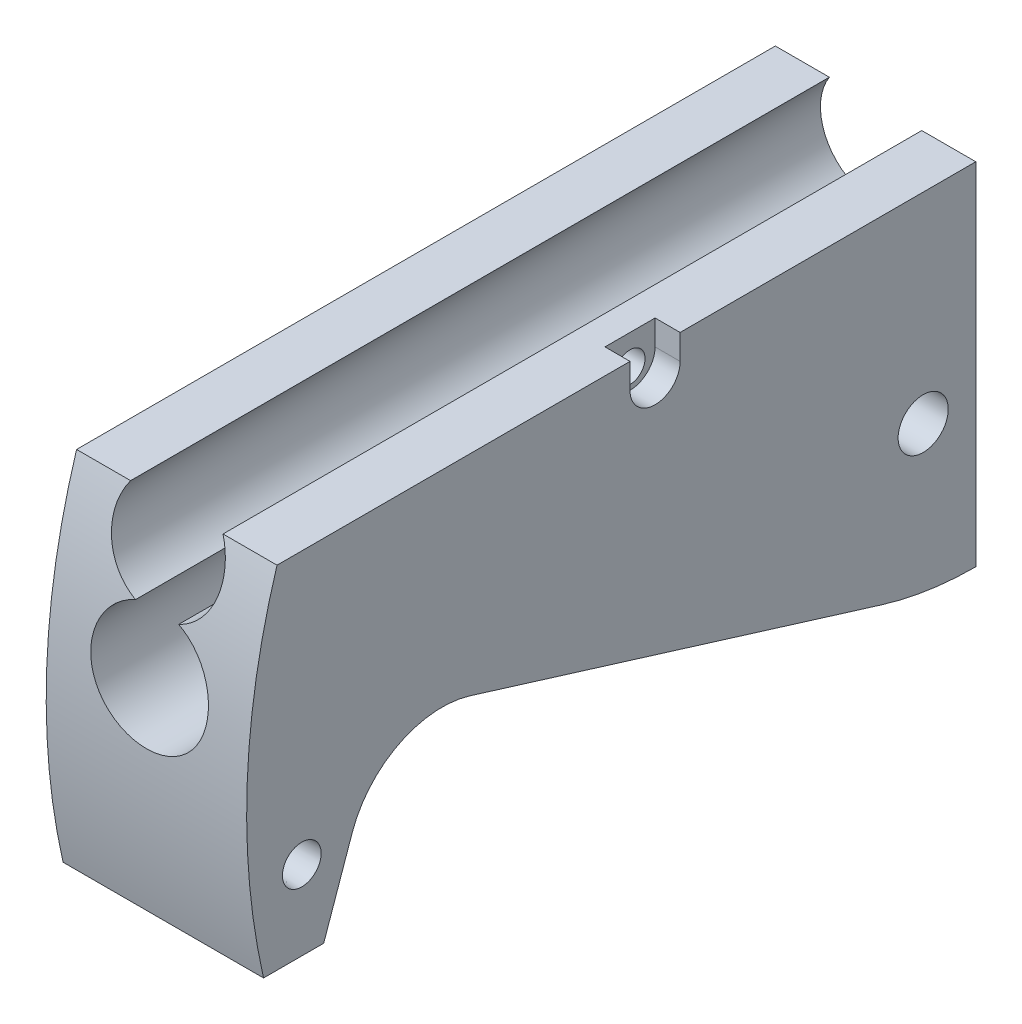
ISO-10303-21;
HEADER;
FILE_DESCRIPTION(('STEP AP214'),'2;1');
FILE_NAME('part.step','',(''),(''),'','','');
FILE_SCHEMA(('AUTOMOTIVE_DESIGN { 1 0 10303 214 1 1 1 1 }'));
ENDSEC;
DATA;
#1=APPLICATION_CONTEXT('core data for automotive mechanical design processes');
#2=APPLICATION_PROTOCOL_DEFINITION('international standard','automotive_design',2000,#1);
#3=PRODUCT_CONTEXT('',#1,'mechanical');
#4=PRODUCT('Part','Part','',(#3));
#5=PRODUCT_RELATED_PRODUCT_CATEGORY('part','',(#4));
#6=PRODUCT_DEFINITION_FORMATION('','',#4);
#7=PRODUCT_DEFINITION_CONTEXT('part definition',#1,'design');
#8=PRODUCT_DEFINITION('design','',#6,#7);
#9=PRODUCT_DEFINITION_SHAPE('','',#8);
#10=(LENGTH_UNIT() NAMED_UNIT(*) SI_UNIT(.MILLI.,.METRE.));
#11=(NAMED_UNIT(*) PLANE_ANGLE_UNIT() SI_UNIT($,.RADIAN.));
#12=(NAMED_UNIT(*) SI_UNIT($,.STERADIAN.) SOLID_ANGLE_UNIT());
#13=UNCERTAINTY_MEASURE_WITH_UNIT(LENGTH_MEASURE(1.E-05),#10,'distance_accuracy_value','');
#14=(GEOMETRIC_REPRESENTATION_CONTEXT(3) GLOBAL_UNCERTAINTY_ASSIGNED_CONTEXT((#13)) GLOBAL_UNIT_ASSIGNED_CONTEXT((#10,
#11,#12)) REPRESENTATION_CONTEXT('',''));
#15=CARTESIAN_POINT('',(0.,0.,0.));
#16=DIRECTION('',(0.,0.,1.));
#17=DIRECTION('',(1.,0.,0.));
#18=AXIS2_PLACEMENT_3D('',#15,#16,#17);
#19=CARTESIAN_POINT('',(0.,8.00000000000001,0.));
#20=DIRECTION('',(0.,0.,1.));
#21=DIRECTION('',(1.,0.,0.));
#22=AXIS2_PLACEMENT_3D('',#19,#20,#21);
#23=CYLINDRICAL_SURFACE('',#22,6.);
#24=CARTESIAN_POINT('',(0.,8.00000000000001,114.));
#25=DIRECTION('',(0.,0.,1.));
#26=DIRECTION('',(1.,0.,0.));
#27=AXIS2_PLACEMENT_3D('',#24,#25,#26);
#28=CIRCLE('',#27,6.);
#29=CARTESIAN_POINT('',(6.,8.00000000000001,114.));
#30=VERTEX_POINT('',#29);
#31=EDGE_CURVE('E318',#30,#30,#28,.F.);
#32=ORIENTED_EDGE('',*,*,#31,.F.);
#33=EDGE_LOOP('',(#32));
#34=FACE_BOUND('',#33,.T.);
#35=CARTESIAN_POINT('',(0.,8.00000000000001,64.));
#36=DIRECTION('',(0.,0.,-1.));
#37=DIRECTION('',(-1.,0.,0.));
#38=AXIS2_PLACEMENT_3D('',#35,#36,#37);
#39=CIRCLE('',#38,6.);
#40=CARTESIAN_POINT('',(-6.,8.00000000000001,64.));
#41=VERTEX_POINT('',#40);
#42=EDGE_CURVE('E42',#41,#41,#39,.F.);
#43=ORIENTED_EDGE('',*,*,#42,.F.);
#44=EDGE_LOOP('',(#43));
#45=FACE_BOUND('',#44,.T.);
#46=ADVANCED_FACE('F38',(#34,#45),#23,.F.);
#47=CARTESIAN_POINT('',(0.,0.,0.));
#48=DIRECTION('',(0.,0.,1.));
#49=DIRECTION('',(1.,0.,0.));
#50=AXIS2_PLACEMENT_3D('',#47,#48,#49);
#51=PLANE('',#50);
#52=DIRECTION('',(0.,1.,0.));
#53=VECTOR('',#52,1.);
#54=CARTESIAN_POINT('',(-2.,-35.,0.));
#55=LINE('',#54,#53);
#56=CARTESIAN_POINT('',(-2.,14.1846584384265,0.));
#57=VERTEX_POINT('',#56);
#58=CARTESIAN_POINT('',(-2.,18.183346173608,0.));
#59=VERTEX_POINT('',#58);
#60=EDGE_CURVE('E331',#57,#59,#55,.T.);
#61=ORIENTED_EDGE('',*,*,#60,.F.);
#62=CARTESIAN_POINT('',(0.,8.00000000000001,0.));
#63=DIRECTION('',(0.,0.,-1.));
#64=DIRECTION('',(-1.,0.,0.));
#65=AXIS2_PLACEMENT_3D('',#62,#63,#64);
#66=CIRCLE('',#65,6.5);
#67=CARTESIAN_POINT('',(-2.,1.81534156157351,0.));
#68=VERTEX_POINT('',#67);
#69=EDGE_CURVE('E267',#68,#57,#66,.T.);
#70=ORIENTED_EDGE('',*,*,#69,.F.);
#71=CARTESIAN_POINT('',(-2.,-35.,0.));
#72=VERTEX_POINT('',#71);
#73=EDGE_CURVE('E327',#72,#68,#55,.T.);
#74=ORIENTED_EDGE('',*,*,#73,.F.);
#75=DIRECTION('',(1.,0.,0.));
#76=VECTOR('',#75,1.);
#77=CARTESIAN_POINT('',(-20.,-35.,0.));
#78=LINE('',#77,#76);
#79=CARTESIAN_POINT('',(-20.,-35.,0.));
#80=VERTEX_POINT('',#79);
#81=EDGE_CURVE('E404',#80,#72,#78,.T.);
#82=ORIENTED_EDGE('',*,*,#81,.F.);
#83=DIRECTION('',(0.,-1.,0.));
#84=VECTOR('',#83,1.);
#85=CARTESIAN_POINT('',(-20.,35.,0.));
#86=LINE('',#85,#84);
#87=CARTESIAN_POINT('',(-20.,35.,0.));
#88=VERTEX_POINT('',#87);
#89=EDGE_CURVE('E400',#88,#80,#86,.T.);
#90=ORIENTED_EDGE('',*,*,#89,.F.);
#91=DIRECTION('',(-1.,0.,0.));
#92=VECTOR('',#91,1.);
#93=CARTESIAN_POINT('',(-20.,35.,0.));
#94=LINE('',#93,#92);
#95=CARTESIAN_POINT('',(-9.21954445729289,35.,0.));
#96=VERTEX_POINT('',#95);
#97=EDGE_CURVE('E396',#96,#88,#94,.T.);
#98=ORIENTED_EDGE('',*,*,#97,.F.);
#99=CARTESIAN_POINT('',(0.,29.,0.));
#100=DIRECTION('',(0.,0.,1.));
#101=DIRECTION('',(1.,0.,0.));
#102=AXIS2_PLACEMENT_3D('',#99,#100,#101);
#103=CIRCLE('',#102,11.);
#104=EDGE_CURVE('E348',#96,#59,#103,.T.);
#105=ORIENTED_EDGE('',*,*,#104,.T.);
#106=EDGE_LOOP('',(#61,#70,#74,#82,#90,#98,#105));
#107=FACE_BOUND('',#106,.T.);
#108=ADVANCED_FACE('F485',(#107),#51,.F.);
#109=CARTESIAN_POINT('',(-127.,-5.00000000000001,10.5));
#110=DIRECTION('',(1.,0.,0.));
#111=DIRECTION('',(0.,1.,0.));
#112=AXIS2_PLACEMENT_3D('',#109,#110,#111);
#113=CYLINDRICAL_SURFACE('',#112,5.);
#114=CARTESIAN_POINT('',(-20.,-5.,10.5));
#115=DIRECTION('',(1.,0.,0.));
#116=DIRECTION('',(0.,1.,0.));
#117=AXIS2_PLACEMENT_3D('',#114,#115,#116);
#118=CIRCLE('',#117,5.);
#119=CARTESIAN_POINT('',(-20.,0.,10.5));
#120=VERTEX_POINT('',#119);
#121=EDGE_CURVE('E392',#120,#120,#118,.T.);
#122=ORIENTED_EDGE('',*,*,#121,.F.);
#123=EDGE_LOOP('',(#122));
#124=FACE_BOUND('',#123,.T.);
#125=CARTESIAN_POINT('',(-2.,-5.,10.5));
#126=DIRECTION('',(1.,0.,0.));
#127=DIRECTION('',(0.,0.,-1.));
#128=AXIS2_PLACEMENT_3D('',#125,#126,#127);
#129=CIRCLE('',#128,5.);
#130=CARTESIAN_POINT('',(-2.,-5.,5.50000000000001));
#131=VERTEX_POINT('',#130);
#132=EDGE_CURVE('E341',#131,#131,#129,.F.);
#133=ORIENTED_EDGE('',*,*,#132,.F.);
#134=EDGE_LOOP('',(#133));
#135=FACE_BOUND('',#134,.T.);
#136=ADVANCED_FACE('F490',(#124,#135),#113,.F.);
#137=CARTESIAN_POINT('',(-127.,29.,0.));
#138=DIRECTION('',(1.,0.,0.));
#139=DIRECTION('',(0.,1.,0.));
#140=AXIS2_PLACEMENT_3D('',#137,#138,#139);
#141=CYLINDRICAL_SURFACE('',#140,64.);
#142=ORIENTED_EDGE('',*,*,#81,.T.);
#143=CARTESIAN_POINT('',(-2.,29.,0.));
#144=DIRECTION('',(1.,0.,0.));
#145=DIRECTION('',(0.,0.,-1.));
#146=AXIS2_PLACEMENT_3D('',#143,#144,#145);
#147=CIRCLE('',#146,64.);
#148=CARTESIAN_POINT('',(-2.,-32.1549799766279,18.8697754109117));
#149=VERTEX_POINT('',#148);
#150=EDGE_CURVE('E322',#149,#72,#147,.T.);
#151=ORIENTED_EDGE('',*,*,#150,.F.);
#152=DIRECTION('',(1.,0.,0.));
#153=VECTOR('',#152,1.);
#154=CARTESIAN_POINT('',(-127.,-32.1549799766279,18.8697754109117));
#155=LINE('',#154,#153);
#156=CARTESIAN_POINT('',(-20.,-32.1549799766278,18.8697754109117));
#157=VERTEX_POINT('',#156);
#158=EDGE_CURVE('E377',#157,#149,#155,.T.);
#159=ORIENTED_EDGE('',*,*,#158,.F.);
#160=CARTESIAN_POINT('',(-20.,29.,0.));
#161=DIRECTION('',(1.,0.,0.));
#162=DIRECTION('',(0.,1.,0.));
#163=AXIS2_PLACEMENT_3D('',#160,#161,#162);
#164=CIRCLE('',#163,64.);
#165=EDGE_CURVE('E375',#157,#80,#164,.T.);
#166=ORIENTED_EDGE('',*,*,#165,.T.);
#167=EDGE_LOOP('',(#142,#151,#159,#166));
#168=FACE_BOUND('',#167,.T.);
#169=ADVANCED_FACE('F448',(#168),#141,.T.);
#170=CARTESIAN_POINT('',(0.,29.,0.));
#171=DIRECTION('',(0.,0.,1.));
#172=DIRECTION('',(1.,0.,0.));
#173=AXIS2_PLACEMENT_3D('',#170,#171,#172);
#174=CYLINDRICAL_SURFACE('',#173,11.);
#175=CARTESIAN_POINT('',(10.5830052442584,32.,64.));
#176=CARTESIAN_POINT('',(10.583007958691,31.9999963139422,63.8348870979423));
#177=CARTESIAN_POINT('',(10.5869115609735,31.9863224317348,63.6697357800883));
#178=CARTESIAN_POINT('',(10.6020548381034,31.932098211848,63.3442129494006));
#179=CARTESIAN_POINT('',(10.6132979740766,31.8915351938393,63.183843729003));
#180=CARTESIAN_POINT('',(10.6417543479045,31.7849734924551,62.8726416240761));
#181=CARTESIAN_POINT('',(10.6589589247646,31.7190116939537,62.7217952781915));
#182=CARTESIAN_POINT('',(10.697388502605,31.563641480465,62.4332837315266));
#183=CARTESIAN_POINT('',(10.7186138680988,31.4742309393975,62.2956197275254));
#184=CARTESIAN_POINT('',(10.7633157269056,31.2719997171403,62.0337795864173));
#185=CARTESIAN_POINT('',(10.786833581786,31.1586754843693,61.9099993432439));
#186=CARTESIAN_POINT('',(10.8331142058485,30.9129160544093,61.682944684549));
#187=CARTESIAN_POINT('',(10.8558768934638,30.7804788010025,61.5796724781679));
#188=CARTESIAN_POINT('',(10.898545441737,30.49749518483,61.394902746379));
#189=CARTESIAN_POINT('',(10.9183968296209,30.3466817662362,61.3138005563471));
#190=CARTESIAN_POINT('',(10.9525304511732,30.032927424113,61.1782542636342));
#191=CARTESIAN_POINT('',(10.9668136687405,29.869988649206,61.1238054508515));
#192=CARTESIAN_POINT('',(10.9879091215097,29.540742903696,61.0443978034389));
#193=CARTESIAN_POINT('',(10.994891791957,29.3746095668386,61.0187651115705));
#194=CARTESIAN_POINT('',(11.0011960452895,29.0402637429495,60.9955953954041));
#195=CARTESIAN_POINT('',(11.0005189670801,28.8720516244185,60.998053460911));
#196=CARTESIAN_POINT('',(10.9917041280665,28.5430198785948,61.0305247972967));
#197=CARTESIAN_POINT('',(10.9837635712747,28.3821222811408,61.0598097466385));
#198=CARTESIAN_POINT('',(10.9615478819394,28.0676179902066,61.1439246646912));
#199=CARTESIAN_POINT('',(10.9472723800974,27.9140117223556,61.1987561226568));
#200=CARTESIAN_POINT('',(10.9137017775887,27.6166135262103,61.3329542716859));
#201=CARTESIAN_POINT('',(10.8943566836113,27.4729384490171,61.4125668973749));
#202=CARTESIAN_POINT('',(10.852725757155,27.2007414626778,61.5938777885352));
#203=CARTESIAN_POINT('',(10.8304393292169,27.0722226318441,61.6955805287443));
#204=CARTESIAN_POINT('',(10.784492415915,26.8296385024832,61.92203599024));
#205=CARTESIAN_POINT('',(10.7608107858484,26.7161689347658,62.0474233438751));
#206=CARTESIAN_POINT('',(10.715383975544,26.5117184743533,62.3156904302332));
#207=CARTESIAN_POINT('',(10.6936389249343,26.4207390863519,62.458571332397));
#208=CARTESIAN_POINT('',(10.6544594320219,26.2633699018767,62.7591087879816));
#209=CARTESIAN_POINT('',(10.6370548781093,26.1971491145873,62.9168580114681));
#210=CARTESIAN_POINT('',(10.6088947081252,26.0923670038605,63.2418452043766));
#211=CARTESIAN_POINT('',(10.5981373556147,26.0537984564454,63.4090806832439));
#212=CARTESIAN_POINT('',(10.5848615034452,26.0064574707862,63.7427043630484));
#213=CARTESIAN_POINT('',(10.5820965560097,25.9967934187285,63.9089563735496));
#214=CARTESIAN_POINT('',(10.5844430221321,26.0050733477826,64.2407022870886));
#215=CARTESIAN_POINT('',(10.5895535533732,26.0230142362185,64.4061962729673));
#216=CARTESIAN_POINT('',(10.6068364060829,26.0852072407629,64.7282448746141));
#217=CARTESIAN_POINT('',(10.6188630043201,26.128916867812,64.8849128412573));
#218=CARTESIAN_POINT('',(10.6484790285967,26.2407933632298,65.1886920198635));
#219=CARTESIAN_POINT('',(10.6660692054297,26.3089635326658,65.335801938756));
#220=CARTESIAN_POINT('',(10.7053313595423,26.4696151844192,65.6200014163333));
#221=CARTESIAN_POINT('',(10.7270874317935,26.5626166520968,65.7567851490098));
#222=CARTESIAN_POINT('',(10.7720352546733,26.7696511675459,66.0131321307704));
#223=CARTESIAN_POINT('',(10.7952272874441,26.8836883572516,66.1326919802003));
#224=CARTESIAN_POINT('',(10.8412873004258,27.1336932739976,66.3549327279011));
#225=CARTESIAN_POINT('',(10.8641239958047,27.2702223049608,66.4569900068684));
#226=CARTESIAN_POINT('',(10.9061791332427,27.5589888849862,66.636741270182));
#227=CARTESIAN_POINT('',(10.9253977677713,27.7112255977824,66.7144365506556));
#228=CARTESIAN_POINT('',(10.9579274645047,28.0260153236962,66.8425341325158));
#229=CARTESIAN_POINT('',(10.9712828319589,28.1884799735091,66.893141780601));
#230=CARTESIAN_POINT('',(10.9907764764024,28.5200282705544,66.9662139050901));
#231=CARTESIAN_POINT('',(10.9969164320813,28.6891103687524,66.9886849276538));
#232=CARTESIAN_POINT('',(11.0012041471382,29.023279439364,67.0044202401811));
#233=CARTESIAN_POINT('',(10.9996016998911,29.1883208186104,66.9985973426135));
#234=CARTESIAN_POINT('',(10.9891537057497,29.5149826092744,66.96004044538));
#235=CARTESIAN_POINT('',(10.980308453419,29.6766031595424,66.9273075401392));
#236=CARTESIAN_POINT('',(10.9564222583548,29.9906840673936,66.8363852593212));
#237=CARTESIAN_POINT('',(10.9414282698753,30.1432040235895,66.7783886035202));
#238=CARTESIAN_POINT('',(10.9068088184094,30.4364347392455,66.6387567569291));
#239=CARTESIAN_POINT('',(10.8871826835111,30.5771437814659,66.5571181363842));
#240=CARTESIAN_POINT('',(10.8447157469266,30.8469773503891,66.3698905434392));
#241=CARTESIAN_POINT('',(10.821801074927,30.975674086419,66.2637018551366));
#242=CARTESIAN_POINT('',(10.77562687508,31.2137299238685,66.0315157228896));
#243=CARTESIAN_POINT('',(10.7523672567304,31.3230838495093,65.9055129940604));
#244=CARTESIAN_POINT('',(10.7075101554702,31.5218793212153,65.6337449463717));
#245=CARTESIAN_POINT('',(10.685964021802,31.6107975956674,65.4875875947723));
#246=CARTESIAN_POINT('',(10.6477131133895,31.7626761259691,65.1818281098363));
#247=CARTESIAN_POINT('',(10.6310053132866,31.8256526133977,65.0222344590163));
#248=CARTESIAN_POINT('',(10.6065296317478,31.9160522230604,64.7194639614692));
#249=CARTESIAN_POINT('',(10.5977813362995,31.9474566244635,64.57754306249));
#250=CARTESIAN_POINT('',(10.5860183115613,31.9894308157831,64.2904244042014));
#251=CARTESIAN_POINT('',(10.5830028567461,32.000003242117,64.1452270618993));
#252=CARTESIAN_POINT('',(10.5830052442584,32.,64.));
#253=B_SPLINE_CURVE_WITH_KNOTS('',3,(#175,#176,#177,#178,#179,#180,#181,#182,#183,#184,#185,
#186,#187,#188,#189,#190,#191,#192,#193,#194,#195,#196,#197,#198,#199,#200,#201,#202,#203,#204,
#205,#206,#207,#208,#209,#210,#211,#212,#213,#214,#215,#216,#217,#218,#219,#220,#221,#222,#223,
#224,#225,#226,#227,#228,#229,#230,#231,#232,#233,#234,#235,#236,#237,#238,#239,#240,#241,#242,
#243,#244,#245,#246,#247,#248,#249,#250,#251,#252),.UNSPECIFIED.,.T.,.F.,(4,2,2,2,2,2,2,2,2,2,2,
2,2,2,2,2,2,2,2,2,2,2,2,2,2,2,2,2,2,2,2,2,2,2,2,2,2,2,4),(0.,0.494804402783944,
0.989842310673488,1.48416400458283,1.97853053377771,2.48458654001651,2.99069702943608,
3.50531765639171,4.01984730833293,4.52207686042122,5.02421862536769,5.51311924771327,
6.0020483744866,6.49599339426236,6.99003856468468,7.49992833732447,8.00985221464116,
8.52319603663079,9.03640570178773,9.53361223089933,10.0307630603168,10.5178037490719,
11.0049101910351,11.5031485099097,12.0014850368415,12.5149711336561,13.0284299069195,
13.5379390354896,14.0473296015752,14.5403975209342,15.0334453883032,15.5227962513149,
16.0122181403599,16.5151701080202,17.0182564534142,17.5330636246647,18.0475481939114,
18.4828145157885,18.9180257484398),.UNSPECIFIED.);
#254=CARTESIAN_POINT('',(10.5830052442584,32.,64.));
#255=VERTEX_POINT('',#254);
#256=EDGE_CURVE('E236',#255,#255,#253,.T.);
#257=ORIENTED_EDGE('',*,*,#256,.F.);
#258=EDGE_LOOP('',(#257));
#259=FACE_BOUND('',#258,.T.);
#260=CARTESIAN_POINT('',(0.,29.,114.));
#261=DIRECTION('',(0.,0.,1.));
#262=DIRECTION('',(1.,0.,0.));
#263=AXIS2_PLACEMENT_3D('',#260,#261,#262);
#264=CIRCLE('',#263,11.);
#265=CARTESIAN_POINT('',(4.2940769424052,18.8727642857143,114.));
#266=VERTEX_POINT('',#265);
#267=CARTESIAN_POINT('',(-4.2940769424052,18.8727642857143,114.));
#268=VERTEX_POINT('',#267);
#269=EDGE_CURVE('E47',#266,#268,#264,.F.);
#270=ORIENTED_EDGE('',*,*,#269,.F.);
#271=DIRECTION('',(0.,0.,1.));
#272=VECTOR('',#271,1.);
#273=CARTESIAN_POINT('',(4.29407694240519,18.8727642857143,130.5));
#274=LINE('',#273,#272);
#275=CARTESIAN_POINT('',(4.29407694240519,18.8727642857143,143.372461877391));
#276=VERTEX_POINT('',#275);
#277=EDGE_CURVE('E315',#266,#276,#274,.T.);
#278=ORIENTED_EDGE('',*,*,#277,.T.);
#279=CARTESIAN_POINT('',(-9.21954445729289,35.,139.437969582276));
#280=CARTESIAN_POINT('',(-9.39458828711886,34.7310729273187,139.521406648));
#281=CARTESIAN_POINT('',(-9.55762412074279,34.4547717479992,139.606192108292));
#282=CARTESIAN_POINT('',(-9.85877423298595,33.8894766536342,139.777589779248));
#283=CARTESIAN_POINT('',(-9.99689061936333,33.600483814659,139.86420183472));
#284=CARTESIAN_POINT('',(-10.2472978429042,33.011881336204,140.03837734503));
#285=CARTESIAN_POINT('',(-10.3595945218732,32.712274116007,140.125940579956));
#286=CARTESIAN_POINT('',(-10.5576732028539,32.1044634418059,140.301227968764));
#287=CARTESIAN_POINT('',(-10.6434550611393,31.7962599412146,140.388952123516));
#288=CARTESIAN_POINT('',(-10.7879128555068,31.1732942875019,140.563820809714));
#289=CARTESIAN_POINT('',(-10.8465804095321,30.8585301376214,140.650965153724));
#290=CARTESIAN_POINT('',(-10.9362913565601,30.2247307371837,140.8239281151));
#291=CARTESIAN_POINT('',(-10.9673350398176,29.9056955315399,140.909746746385));
#292=CARTESIAN_POINT('',(-11.0014584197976,29.2656771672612,141.079374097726));
#293=CARTESIAN_POINT('',(-11.0045445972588,28.9446944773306,141.163183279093));
#294=CARTESIAN_POINT('',(-10.9825895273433,28.3030203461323,141.328202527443));
#295=CARTESIAN_POINT('',(-10.9575485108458,27.9823289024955,141.409412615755));
#296=CARTESIAN_POINT('',(-10.8794972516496,27.3449507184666,141.56834701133));
#297=CARTESIAN_POINT('',(-10.8266055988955,27.0282527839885,141.646084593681));
#298=CARTESIAN_POINT('',(-10.6931041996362,26.3998668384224,141.797954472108));
#299=CARTESIAN_POINT('',(-10.6124944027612,26.0881788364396,141.872086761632));
#300=CARTESIAN_POINT('',(-10.4239359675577,25.4722095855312,142.016327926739));
#301=CARTESIAN_POINT('',(-10.3159862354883,25.1679286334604,142.08643664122));
#302=CARTESIAN_POINT('',(-10.0733504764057,24.569205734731,142.222269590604));
#303=CARTESIAN_POINT('',(-9.93866505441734,24.2747635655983,142.287993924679));
#304=CARTESIAN_POINT('',(-9.64710794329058,23.7053780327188,142.413168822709));
#305=CARTESIAN_POINT('',(-9.49088021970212,23.4301303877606,142.472735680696));
#306=CARTESIAN_POINT('',(-9.15478894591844,22.8934394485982,142.587211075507));
#307=CARTESIAN_POINT('',(-8.97492573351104,22.6319959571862,142.642119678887));
#308=CARTESIAN_POINT('',(-8.59278799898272,22.1250650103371,142.747109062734));
#309=CARTESIAN_POINT('',(-8.39051709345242,21.8795749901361,142.797190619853));
#310=CARTESIAN_POINT('',(-7.96494289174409,21.4065224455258,142.892423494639));
#311=CARTESIAN_POINT('',(-7.74163996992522,21.178959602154,142.937574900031));
#312=CARTESIAN_POINT('',(-7.28175537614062,20.7493988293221,143.021753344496));
#313=CARTESIAN_POINT('',(-7.04567924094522,20.546884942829,143.06091050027));
#314=CARTESIAN_POINT('',(-6.55675939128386,20.1622601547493,143.134456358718));
#315=CARTESIAN_POINT('',(-6.30391597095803,19.9801488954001,143.168845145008));
#316=CARTESIAN_POINT('',(-5.78327924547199,19.6378024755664,143.232848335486));
#317=CARTESIAN_POINT('',(-5.51548686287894,19.4775659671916,143.262463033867));
#318=CARTESIAN_POINT('',(-4.96687809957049,19.1802515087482,143.316935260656));
#319=CARTESIAN_POINT('',(-4.68606182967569,19.0431733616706,143.341792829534));
#320=CARTESIAN_POINT('',(-4.11842246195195,18.7954505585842,143.386387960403));
#321=CARTESIAN_POINT('',(-3.83178730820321,18.6843896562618,143.406206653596));
#322=CARTESIAN_POINT('',(-3.24997918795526,18.4865781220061,143.441305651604));
#323=CARTESIAN_POINT('',(-2.95480632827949,18.3998271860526,143.456586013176));
#324=CARTESIAN_POINT('',(-2.35805727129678,18.2513208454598,143.482637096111));
#325=CARTESIAN_POINT('',(-2.05648135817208,18.1895643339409,143.493408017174));
#326=CARTESIAN_POINT('',(-1.44909102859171,18.0915277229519,143.510465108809));
#327=CARTESIAN_POINT('',(-1.14327662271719,18.0552475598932,143.516751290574));
#328=CARTESIAN_POINT('',(-0.532081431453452,18.0086365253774,143.524821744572));
#329=CARTESIAN_POINT('',(-0.22671675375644,17.9981003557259,143.526641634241));
#330=CARTESIAN_POINT('',(0.383824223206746,18.002460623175,143.525887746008));
#331=CARTESIAN_POINT('',(0.689000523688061,18.0173568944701,143.523313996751));
#332=CARTESIAN_POINT('',(1.29698280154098,18.0724657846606,143.513766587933));
#333=CARTESIAN_POINT('',(1.59978882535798,18.1126779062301,143.506793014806));
#334=CARTESIAN_POINT('',(2.20088024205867,18.2181062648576,143.488429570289));
#335=CARTESIAN_POINT('',(2.49916563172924,18.2833225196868,143.477039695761));
#336=CARTESIAN_POINT('',(3.08865815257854,18.438138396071,143.44983952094));
#337=CARTESIAN_POINT('',(3.37987514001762,18.5277016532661,143.434035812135));
#338=CARTESIAN_POINT('',(3.95363574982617,18.7305622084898,143.397972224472));
#339=CARTESIAN_POINT('',(4.23617939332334,18.8438594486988,143.37771235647));
#340=CARTESIAN_POINT('',(4.79061450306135,19.0933144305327,143.332707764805));
#341=CARTESIAN_POINT('',(5.06250600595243,19.2294720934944,143.307963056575));
#342=CARTESIAN_POINT('',(5.59375200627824,19.523601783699,143.253965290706));
#343=CARTESIAN_POINT('',(5.85310645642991,19.6815738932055,143.224712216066));
#344=CARTESIAN_POINT('',(6.35855020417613,20.0188238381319,143.161554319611));
#345=CARTESIAN_POINT('',(6.60457981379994,20.198187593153,143.12763064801));
#346=CARTESIAN_POINT('',(7.08053040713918,20.5763150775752,143.055230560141));
#347=CARTESIAN_POINT('',(7.31045137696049,20.775078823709,143.016754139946));
#348=CARTESIAN_POINT('',(7.75265600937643,21.1904958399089,142.935277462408));
#349=CARTESIAN_POINT('',(7.9649394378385,21.4071493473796,142.89227714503));
#350=CARTESIAN_POINT('',(8.37048851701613,21.8567116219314,142.801812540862));
#351=CARTESIAN_POINT('',(8.56375400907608,22.089620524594,142.754348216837));
#352=CARTESIAN_POINT('',(8.93217895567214,22.5727506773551,142.654473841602));
#353=CARTESIAN_POINT('',(9.10710222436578,22.8231414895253,142.602012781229));
#354=CARTESIAN_POINT('',(9.43516285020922,23.3369089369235,142.492759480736));
#355=CARTESIAN_POINT('',(9.58830008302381,23.6002856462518,142.435967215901));
#356=CARTESIAN_POINT('',(9.87189701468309,24.1381000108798,142.318234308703));
#357=CARTESIAN_POINT('',(10.0023557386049,24.4125381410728,142.257293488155));
#358=CARTESIAN_POINT('',(10.2398758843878,24.9704984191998,142.131497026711));
#359=CARTESIAN_POINT('',(10.3469363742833,25.2540209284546,142.06664123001));
#360=CARTESIAN_POINT('',(10.5391135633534,25.8341805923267,141.9318980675));
#361=CARTESIAN_POINT('',(10.6237224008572,26.1309681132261,141.861933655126));
#362=CARTESIAN_POINT('',(10.7675933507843,26.7298091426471,141.718573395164));
#363=CARTESIAN_POINT('',(10.8268550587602,27.031862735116,141.645177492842));
#364=CARTESIAN_POINT('',(10.9198168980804,27.6391345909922,141.49536135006));
#365=CARTESIAN_POINT('',(10.9535168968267,27.9443528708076,141.418941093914));
#366=CARTESIAN_POINT('',(10.9953121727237,28.5560130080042,141.263502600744));
#367=CARTESIAN_POINT('',(11.0033963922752,28.8624553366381,141.184483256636));
#368=CARTESIAN_POINT('',(10.9938948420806,29.4828699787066,141.022171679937));
#369=CARTESIAN_POINT('',(10.9755935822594,29.7968163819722,140.938821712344));
#370=CARTESIAN_POINT('',(10.9122871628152,30.4214434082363,140.77058738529));
#371=CARTESIAN_POINT('',(10.8672928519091,30.7321253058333,140.685703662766));
#372=CARTESIAN_POINT('',(10.751004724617,31.3482190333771,140.515034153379));
#373=CARTESIAN_POINT('',(10.6797159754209,31.6536318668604,140.429248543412));
#374=CARTESIAN_POINT('',(10.5113976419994,32.2570959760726,140.257494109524));
#375=CARTESIAN_POINT('',(10.4143743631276,32.5551490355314,140.171525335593));
#376=CARTESIAN_POINT('',(10.1640366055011,33.2253927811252,139.975762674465));
#377=CARTESIAN_POINT('',(10.002561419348,33.5946364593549,139.866126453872));
#378=CARTESIAN_POINT('',(9.73072600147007,34.1335618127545,139.703713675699));
#379=CARTESIAN_POINT('',(9.6352436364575,34.3106112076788,139.649948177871));
#380=CARTESIAN_POINT('',(9.43460132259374,34.6593939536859,139.543270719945));
#381=CARTESIAN_POINT('',(9.32944174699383,34.8311275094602,139.490358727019));
#382=CARTESIAN_POINT('',(9.21954445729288,35.,139.437969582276));
#383=B_SPLINE_CURVE_WITH_KNOTS('',3,(#279,#280,#281,#282,#283,#284,#285,#286,#287,#288,#289,
#290,#291,#292,#293,#294,#295,#296,#297,#298,#299,#300,#301,#302,#303,#304,#305,#306,#307,#308,
#309,#310,#311,#312,#313,#314,#315,#316,#317,#318,#319,#320,#321,#322,#323,#324,#325,#326,#327,
#328,#329,#330,#331,#332,#333,#334,#335,#336,#337,#338,#339,#340,#341,#342,#343,#344,#345,#346,
#347,#348,#349,#350,#351,#352,#353,#354,#355,#356,#357,#358,#359,#360,#361,#362,#363,#364,#365,
#366,#367,#368,#369,#370,#371,#372,#373,#374,#375,#376,#377,#378,#379,#380,#381,#382),
.UNSPECIFIED.,.F.,.F.,(4,2,2,2,2,2,2,2,2,2,2,2,2,2,2,2,2,2,2,2,2,2,2,2,2,2,2,2,2,2,2,2,2,2,2,2,
2,2,2,2,2,2,2,2,2,2,2,2,2,2,2,4),(0.,0.994316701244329,1.98854926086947,2.98255664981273,
3.97656942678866,4.97088928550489,5.96519869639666,6.95927761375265,7.9533483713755,
8.9432201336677,9.93309369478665,10.9230068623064,11.9128976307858,12.8778656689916,
13.8428199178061,14.8076186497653,15.7724002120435,16.7117367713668,17.6510568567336,
18.5903190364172,19.5295732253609,20.4525794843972,21.3755741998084,22.2985280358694,
23.2214795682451,24.1370465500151,25.0526075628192,25.9681505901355,26.8836942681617,
27.7978779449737,28.7120593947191,29.6262376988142,30.5404194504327,31.4584051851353,
32.3763917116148,33.2943904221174,34.2123967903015,35.1410581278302,36.0697247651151,
36.9984313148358,37.927174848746,38.8754159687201,39.8236722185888,40.7719333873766,
41.7206038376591,42.6954881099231,43.6699764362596,44.6442770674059,45.6183392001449,
46.8686488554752,47.4930504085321,48.1174278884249),.UNSPECIFIED.);
#384=CARTESIAN_POINT('',(9.21954445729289,35.,139.437969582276));
#385=VERTEX_POINT('',#384);
#386=EDGE_CURVE('E430',#276,#385,#383,.T.);
#387=ORIENTED_EDGE('',*,*,#386,.T.);
#388=DIRECTION('',(0.,0.,1.));
#389=VECTOR('',#388,1.);
#390=CARTESIAN_POINT('',(9.21954445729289,35.,0.));
#391=LINE('',#390,#389);
#392=CARTESIAN_POINT('',(9.21954445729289,35.,0.));
#393=VERTEX_POINT('',#392);
#394=EDGE_CURVE('E351',#393,#385,#391,.T.);
#395=ORIENTED_EDGE('',*,*,#394,.F.);
#396=CARTESIAN_POINT('',(2.,18.183346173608,0.));
#397=VERTEX_POINT('',#396);
#398=EDGE_CURVE('E347',#397,#393,#103,.T.);
#399=ORIENTED_EDGE('',*,*,#398,.F.);
#400=DIRECTION('',(0.,0.,1.));
#401=VECTOR('',#400,1.);
#402=CARTESIAN_POINT('',(2.,18.183346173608,0.));
#403=LINE('',#402,#401);
#404=CARTESIAN_POINT('',(2.,18.183346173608,63.0793151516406));
#405=VERTEX_POINT('',#404);
#406=EDGE_CURVE('E438',#397,#405,#403,.T.);
#407=ORIENTED_EDGE('',*,*,#406,.T.);
#408=CARTESIAN_POINT('',(2.,18.183346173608,63.0793151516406));
#409=CARTESIAN_POINT('',(1.83452714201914,18.1527497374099,63.0740674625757));
#410=CARTESIAN_POINT('',(1.66835426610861,18.1259523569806,63.069450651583));
#411=CARTESIAN_POINT('',(1.33492442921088,18.0800044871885,63.0615117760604));
#412=CARTESIAN_POINT('',(1.16766747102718,18.0608539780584,63.0581897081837));
#413=CARTESIAN_POINT('',(0.667691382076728,18.0152148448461,63.0502618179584));
#414=CARTESIAN_POINT('',(0.333845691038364,18.,63.0476010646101));
#415=CARTESIAN_POINT('',(-0.333845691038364,18.,63.0476010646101));
#416=CARTESIAN_POINT('',(-0.667691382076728,18.0152148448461,63.0502618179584));
#417=CARTESIAN_POINT('',(-1.16766747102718,18.0608539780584,63.0581897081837));
#418=CARTESIAN_POINT('',(-1.33492442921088,18.0800044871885,63.0615117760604));
#419=CARTESIAN_POINT('',(-1.66835426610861,18.1259523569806,63.069450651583));
#420=CARTESIAN_POINT('',(-1.83452714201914,18.1527497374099,63.0740674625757));
#421=CARTESIAN_POINT('',(-2.,18.183346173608,63.0793151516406));
#422=B_SPLINE_CURVE_WITH_KNOTS('',3,(#408,#409,#410,#411,#412,#413,#414,#415,#416,#417,#418,
#419,#420,#421),.UNSPECIFIED.,.F.,.F.,(4,2,2,2,2,2,4),(0.,0.504989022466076,1.00997673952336,
2.01107106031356,3.01216538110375,3.51715309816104,4.02214212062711),.UNSPECIFIED.);
#423=CARTESIAN_POINT('',(-2.,18.183346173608,63.0793151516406));
#424=VERTEX_POINT('',#423);
#425=EDGE_CURVE('E451',#405,#424,#422,.T.);
#426=ORIENTED_EDGE('',*,*,#425,.T.);
#427=DIRECTION('',(0.,0.,1.));
#428=VECTOR('',#427,1.);
#429=CARTESIAN_POINT('',(-2.,18.183346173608,0.));
#430=LINE('',#429,#428);
#431=EDGE_CURVE('E457',#59,#424,#430,.T.);
#432=ORIENTED_EDGE('',*,*,#431,.F.);
#433=ORIENTED_EDGE('',*,*,#104,.F.);
#434=DIRECTION('',(0.,0.,1.));
#435=VECTOR('',#434,1.);
#436=CARTESIAN_POINT('',(-9.21954445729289,35.,0.));
#437=LINE('',#436,#435);
#438=CARTESIAN_POINT('',(-9.21954445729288,35.,139.437969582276));
#439=VERTEX_POINT('',#438);
#440=EDGE_CURVE('E352',#96,#439,#437,.T.);
#441=ORIENTED_EDGE('',*,*,#440,.T.);
#442=CARTESIAN_POINT('',(-4.29407694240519,18.8727642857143,143.372461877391));
#443=VERTEX_POINT('',#442);
#444=EDGE_CURVE('E431',#439,#443,#383,.T.);
#445=ORIENTED_EDGE('',*,*,#444,.T.);
#446=DIRECTION('',(0.,0.,1.));
#447=VECTOR('',#446,1.);
#448=CARTESIAN_POINT('',(-4.29407694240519,18.8727642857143,130.5));
#449=LINE('',#448,#447);
#450=EDGE_CURVE('E312',#443,#268,#449,.F.);
#451=ORIENTED_EDGE('',*,*,#450,.T.);
#452=EDGE_LOOP('',(#270,#278,#387,#395,#399,#407,#426,#432,#433,#441,#445,#451));
#453=FACE_BOUND('',#452,.T.);
#454=ADVANCED_FACE('F444',(#259,#453),#174,.F.);
#455=CARTESIAN_POINT('',(-20.,35.,147.));
#456=DIRECTION('',(0.,-1.,0.));
#457=DIRECTION('',(0.,0.,-1.));
#458=AXIS2_PLACEMENT_3D('',#455,#456,#457);
#459=PLANE('',#458);
#460=DIRECTION('',(0.,0.,-1.));
#461=VECTOR('',#460,1.);
#462=CARTESIAN_POINT('',(20.,35.,147.));
#463=LINE('',#462,#461);
#464=CARTESIAN_POINT('',(20.,35.,139.437969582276));
#465=VERTEX_POINT('',#464);
#466=CARTESIAN_POINT('',(20.,35.,69.));
#467=VERTEX_POINT('',#466);
#468=EDGE_CURVE('E417',#465,#467,#463,.T.);
#469=ORIENTED_EDGE('',*,*,#468,.T.);
#470=DIRECTION('',(1.,0.,0.));
#471=VECTOR('',#470,1.);
#472=CARTESIAN_POINT('',(15.,35.,69.));
#473=LINE('',#472,#471);
#474=CARTESIAN_POINT('',(15.,35.,69.));
#475=VERTEX_POINT('',#474);
#476=EDGE_CURVE('E241',#475,#467,#473,.T.);
#477=ORIENTED_EDGE('',*,*,#476,.F.);
#478=DIRECTION('',(0.,0.,1.));
#479=VECTOR('',#478,1.);
#480=CARTESIAN_POINT('',(15.,35.,59.));
#481=LINE('',#480,#479);
#482=CARTESIAN_POINT('',(15.,35.,59.));
#483=VERTEX_POINT('',#482);
#484=EDGE_CURVE('E220',#483,#475,#481,.T.);
#485=ORIENTED_EDGE('',*,*,#484,.F.);
#486=DIRECTION('',(1.,0.,0.));
#487=VECTOR('',#486,1.);
#488=CARTESIAN_POINT('',(15.,35.,59.));
#489=LINE('',#488,#487);
#490=CARTESIAN_POINT('',(20.,35.,59.));
#491=VERTEX_POINT('',#490);
#492=EDGE_CURVE('E211',#483,#491,#489,.T.);
#493=ORIENTED_EDGE('',*,*,#492,.T.);
#494=CARTESIAN_POINT('',(20.,35.,0.));
#495=VERTEX_POINT('',#494);
#496=EDGE_CURVE('E416',#491,#495,#463,.T.);
#497=ORIENTED_EDGE('',*,*,#496,.T.);
#498=EDGE_CURVE('E397',#495,#393,#94,.T.);
#499=ORIENTED_EDGE('',*,*,#498,.T.);
#500=ORIENTED_EDGE('',*,*,#394,.T.);
#501=DIRECTION('',(1.,0.,0.));
#502=VECTOR('',#501,1.);
#503=CARTESIAN_POINT('',(-127.,35.,139.437969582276));
#504=LINE('',#503,#502);
#505=EDGE_CURVE('E376',#385,#465,#504,.T.);
#506=ORIENTED_EDGE('',*,*,#505,.T.);
#507=EDGE_LOOP('',(#469,#477,#485,#493,#497,#499,#500,#506));
#508=FACE_BOUND('',#507,.T.);
#509=ADVANCED_FACE('F447',(#508),#459,.F.);
#510=CARTESIAN_POINT('',(20.,35.,147.));
#511=DIRECTION('',(-1.,0.,0.));
#512=DIRECTION('',(0.,-1.,0.));
#513=AXIS2_PLACEMENT_3D('',#510,#511,#512);
#514=PLANE('',#513);
#515=CARTESIAN_POINT('',(20.,-19.2,134.5));
#516=DIRECTION('',(1.,0.,0.));
#517=DIRECTION('',(0.,1.,0.));
#518=AXIS2_PLACEMENT_3D('',#515,#516,#517);
#519=CIRCLE('',#518,3.865);
#520=CARTESIAN_POINT('',(20.,-15.335,134.5));
#521=VERTEX_POINT('',#520);
#522=EDGE_CURVE('E261',#521,#521,#519,.T.);
#523=ORIENTED_EDGE('',*,*,#522,.F.);
#524=EDGE_LOOP('',(#523));
#525=FACE_BOUND('',#524,.T.);
#526=CARTESIAN_POINT('',(20.,-5.,10.5));
#527=DIRECTION('',(1.,0.,0.));
#528=DIRECTION('',(0.,1.,0.));
#529=AXIS2_PLACEMENT_3D('',#526,#527,#528);
#530=CIRCLE('',#529,5.);
#531=CARTESIAN_POINT('',(20.,0.,10.5));
#532=VERTEX_POINT('',#531);
#533=EDGE_CURVE('E389',#532,#532,#530,.T.);
#534=ORIENTED_EDGE('',*,*,#533,.F.);
#535=EDGE_LOOP('',(#534));
#536=FACE_BOUND('',#535,.T.);
#537=CARTESIAN_POINT('',(20.,30.,64.));
#538=DIRECTION('',(1.,0.,0.));
#539=DIRECTION('',(0.,1.,0.));
#540=AXIS2_PLACEMENT_3D('',#537,#538,#539);
#541=CIRCLE('',#540,5.00000000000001);
#542=CARTESIAN_POINT('',(20.,30.,69.));
#543=VERTEX_POINT('',#542);
#544=CARTESIAN_POINT('',(20.,30.,59.));
#545=VERTEX_POINT('',#544);
#546=EDGE_CURVE('E54',#543,#545,#541,.T.);
#547=ORIENTED_EDGE('',*,*,#546,.F.);
#548=DIRECTION('',(0.,-1.,0.));
#549=VECTOR('',#548,1.);
#550=CARTESIAN_POINT('',(20.,30.,69.));
#551=LINE('',#550,#549);
#552=EDGE_CURVE('E224',#467,#543,#551,.T.);
#553=ORIENTED_EDGE('',*,*,#552,.F.);
#554=ORIENTED_EDGE('',*,*,#468,.F.);
#555=CARTESIAN_POINT('',(20.,-5.,10.5));
#556=DIRECTION('',(1.,0.,0.));
#557=DIRECTION('',(0.,1.,0.));
#558=AXIS2_PLACEMENT_3D('',#555,#556,#557);
#559=CIRCLE('',#558,135.);
#560=CARTESIAN_POINT('',(20.,-35.,142.124465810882));
#561=VERTEX_POINT('',#560);
#562=EDGE_CURVE('E368',#465,#561,#559,.T.);
#563=ORIENTED_EDGE('',*,*,#562,.T.);
#564=DIRECTION('',(0.,0.,-1.));
#565=VECTOR('',#564,1.);
#566=CARTESIAN_POINT('',(20.,-35.,147.));
#567=LINE('',#566,#565);
#568=CARTESIAN_POINT('',(20.,-35.,130.124465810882));
#569=VERTEX_POINT('',#568);
#570=EDGE_CURVE('E407',#561,#569,#567,.T.);
#571=ORIENTED_EDGE('',*,*,#570,.T.);
#572=DIRECTION('',(0.,0.943960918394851,-0.330057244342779));
#573=VECTOR('',#572,1.);
#574=CARTESIAN_POINT('',(20.,-35.,130.124465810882));
#575=LINE('',#574,#573);
#576=CARTESIAN_POINT('',(20.,-18.7289123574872,124.435257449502));
#577=VERTEX_POINT('',#576);
#578=EDGE_CURVE('E354',#569,#577,#575,.T.);
#579=ORIENTED_EDGE('',*,*,#578,.T.);
#580=CARTESIAN_POINT('',(20.,-25.,106.5));
#581=DIRECTION('',(-1.,0.,0.));
#582=DIRECTION('',(0.,-1.,0.));
#583=AXIS2_PLACEMENT_3D('',#580,#581,#582);
#584=CIRCLE('',#583,19.);
#585=CARTESIAN_POINT('',(20.,-6.84461531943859,100.898035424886));
#586=VERTEX_POINT('',#585);
#587=EDGE_CURVE('E359',#577,#586,#584,.T.);
#588=ORIENTED_EDGE('',*,*,#587,.T.);
#589=DIRECTION('',(0.,-0.294840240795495,-0.95554656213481));
#590=VECTOR('',#589,1.);
#591=CARTESIAN_POINT('',(20.,-6.8446153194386,100.898035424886));
#592=LINE('',#591,#590);
#593=CARTESIAN_POINT('',(20.,-32.1549799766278,18.8697754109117));
#594=VERTEX_POINT('',#593);
#595=EDGE_CURVE('E362',#586,#594,#592,.T.);
#596=ORIENTED_EDGE('',*,*,#595,.T.);
#597=CARTESIAN_POINT('',(20.,29.,0.));
#598=DIRECTION('',(1.,0.,0.));
#599=DIRECTION('',(0.,1.,0.));
#600=AXIS2_PLACEMENT_3D('',#597,#598,#599);
#601=CIRCLE('',#600,64.);
#602=CARTESIAN_POINT('',(20.,-35.,0.));
#603=VERTEX_POINT('',#602);
#604=EDGE_CURVE('E365',#594,#603,#601,.T.);
#605=ORIENTED_EDGE('',*,*,#604,.T.);
#606=DIRECTION('',(0.,1.,0.));
#607=VECTOR('',#606,1.);
#608=CARTESIAN_POINT('',(20.,35.,0.));
#609=LINE('',#608,#607);
#610=EDGE_CURVE('E393',#603,#495,#609,.T.);
#611=ORIENTED_EDGE('',*,*,#610,.T.);
#612=ORIENTED_EDGE('',*,*,#496,.F.);
#613=DIRECTION('',(0.,1.,0.));
#614=VECTOR('',#613,1.);
#615=CARTESIAN_POINT('',(20.,30.,59.));
#616=LINE('',#615,#614);
#617=EDGE_CURVE('E227',#545,#491,#616,.T.);
#618=ORIENTED_EDGE('',*,*,#617,.F.);
#619=EDGE_LOOP('',(#547,#553,#554,#563,#571,#579,#588,#596,#605,#611,#612,#618));
#620=FACE_BOUND('',#619,.T.);
#621=ADVANCED_FACE('F40',(#525,#536,#620),#514,.F.);
#622=CARTESIAN_POINT('',(-20.,35.,139.437969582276));
#623=VERTEX_POINT('',#622);
#624=EDGE_CURVE('E372',#623,#439,#504,.T.);
#625=ORIENTED_EDGE('',*,*,#624,.T.);
#626=ORIENTED_EDGE('',*,*,#440,.F.);
#627=ORIENTED_EDGE('',*,*,#97,.T.);
#628=DIRECTION('',(0.,0.,-1.));
#629=VECTOR('',#628,1.);
#630=CARTESIAN_POINT('',(-20.,35.,147.));
#631=LINE('',#630,#629);
#632=EDGE_CURVE('E413',#623,#88,#631,.T.);
#633=ORIENTED_EDGE('',*,*,#632,.F.);
#634=EDGE_LOOP('',(#625,#626,#627,#633));
#635=FACE_BOUND('',#634,.T.);
#636=ADVANCED_FACE('F728',(#635),#459,.F.);
#637=CARTESIAN_POINT('',(-20.,35.,147.));
#638=DIRECTION('',(1.,0.,0.));
#639=DIRECTION('',(0.,1.,0.));
#640=AXIS2_PLACEMENT_3D('',#637,#638,#639);
#641=PLANE('',#640);
#642=CARTESIAN_POINT('',(-20.,-5.,64.));
#643=DIRECTION('',(-1.,0.,0.));
#644=DIRECTION('',(0.,-1.,0.));
#645=AXIS2_PLACEMENT_3D('',#642,#643,#644);
#646=CIRCLE('',#645,4.05);
#647=CARTESIAN_POINT('',(-20.,-9.05,64.));
#648=VERTEX_POINT('',#647);
#649=EDGE_CURVE('E249',#648,#648,#646,.T.);
#650=ORIENTED_EDGE('',*,*,#649,.F.);
#651=EDGE_LOOP('',(#650));
#652=FACE_BOUND('',#651,.T.);
#653=ORIENTED_EDGE('',*,*,#121,.T.);
#654=EDGE_LOOP('',(#653));
#655=FACE_BOUND('',#654,.T.);
#656=CARTESIAN_POINT('',(-20.,-5.,10.5));
#657=DIRECTION('',(1.,0.,0.));
#658=DIRECTION('',(0.,1.,0.));
#659=AXIS2_PLACEMENT_3D('',#656,#657,#658);
#660=CIRCLE('',#659,135.);
#661=CARTESIAN_POINT('',(-20.,-35.,142.124465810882));
#662=VERTEX_POINT('',#661);
#663=EDGE_CURVE('E387',#623,#662,#660,.T.);
#664=ORIENTED_EDGE('',*,*,#663,.F.);
#665=ORIENTED_EDGE('',*,*,#632,.T.);
#666=ORIENTED_EDGE('',*,*,#89,.T.);
#667=ORIENTED_EDGE('',*,*,#165,.F.);
#668=DIRECTION('',(0.,-0.294840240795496,-0.95554656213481));
#669=VECTOR('',#668,1.);
#670=CARTESIAN_POINT('',(-20.,9.78144066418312,154.781354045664));
#671=LINE('',#670,#669);
#672=CARTESIAN_POINT('',(-20.,-6.8446153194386,100.898035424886));
#673=VERTEX_POINT('',#672);
#674=EDGE_CURVE('E428',#673,#157,#671,.T.);
#675=ORIENTED_EDGE('',*,*,#674,.F.);
#676=CARTESIAN_POINT('',(-20.,-25.,106.5));
#677=DIRECTION('',(1.,0.,0.));
#678=DIRECTION('',(0.,1.,0.));
#679=AXIS2_PLACEMENT_3D('',#676,#677,#678);
#680=CIRCLE('',#679,19.);
#681=CARTESIAN_POINT('',(-20.,-18.7289123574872,124.435257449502));
#682=VERTEX_POINT('',#681);
#683=EDGE_CURVE('E426',#682,#673,#680,.F.);
#684=ORIENTED_EDGE('',*,*,#683,.F.);
#685=DIRECTION('',(0.,0.943960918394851,-0.330057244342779));
#686=VECTOR('',#685,1.);
#687=CARTESIAN_POINT('',(-20.,22.1165944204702,110.153569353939));
#688=LINE('',#687,#686);
#689=CARTESIAN_POINT('',(-20.,-35.,130.124465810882));
#690=VERTEX_POINT('',#689);
#691=EDGE_CURVE('E385',#690,#682,#688,.T.);
#692=ORIENTED_EDGE('',*,*,#691,.F.);
#693=DIRECTION('',(0.,0.,-1.));
#694=VECTOR('',#693,1.);
#695=CARTESIAN_POINT('',(-20.,-35.,147.));
#696=LINE('',#695,#694);
#697=EDGE_CURVE('E410',#662,#690,#696,.T.);
#698=ORIENTED_EDGE('',*,*,#697,.F.);
#699=EDGE_LOOP('',(#664,#665,#666,#667,#675,#684,#692,#698));
#700=FACE_BOUND('',#699,.T.);
#701=ADVANCED_FACE('F787',(#652,#655,#700),#641,.F.);
#702=CARTESIAN_POINT('',(-20.,-35.,147.));
#703=DIRECTION('',(0.,1.,0.));
#704=DIRECTION('',(0.,0.,1.));
#705=AXIS2_PLACEMENT_3D('',#702,#703,#704);
#706=PLANE('',#705);
#707=DIRECTION('',(1.,0.,0.));
#708=VECTOR('',#707,1.);
#709=CARTESIAN_POINT('',(-127.,-35.,142.124465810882));
#710=LINE('',#709,#708);
#711=EDGE_CURVE('E424',#662,#561,#710,.T.);
#712=ORIENTED_EDGE('',*,*,#711,.F.);
#713=ORIENTED_EDGE('',*,*,#697,.T.);
#714=DIRECTION('',(-1.,0.,0.));
#715=VECTOR('',#714,1.);
#716=CARTESIAN_POINT('',(-20.,-35.,130.124465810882));
#717=LINE('',#716,#715);
#718=EDGE_CURVE('E420',#569,#690,#717,.T.);
#719=ORIENTED_EDGE('',*,*,#718,.F.);
#720=ORIENTED_EDGE('',*,*,#570,.F.);
#721=EDGE_LOOP('',(#712,#713,#719,#720));
#722=FACE_BOUND('',#721,.T.);
#723=ADVANCED_FACE('F794',(#722),#706,.F.);
#724=DIRECTION('',(0.,1.,0.));
#725=VECTOR('',#724,1.);
#726=CARTESIAN_POINT('',(2.,-35.,0.));
#727=LINE('',#726,#725);
#728=CARTESIAN_POINT('',(2.,-35.,0.));
#729=VERTEX_POINT('',#728);
#730=CARTESIAN_POINT('',(2.,1.81534156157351,0.));
#731=VERTEX_POINT('',#730);
#732=EDGE_CURVE('E325',#729,#731,#727,.T.);
#733=ORIENTED_EDGE('',*,*,#732,.T.);
#734=CARTESIAN_POINT('',(2.,14.1846584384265,0.));
#735=VERTEX_POINT('',#734);
#736=EDGE_CURVE('E62',#735,#731,#66,.T.);
#737=ORIENTED_EDGE('',*,*,#736,.F.);
#738=EDGE_CURVE('E338',#735,#397,#727,.T.);
#739=ORIENTED_EDGE('',*,*,#738,.T.);
#740=ORIENTED_EDGE('',*,*,#398,.T.);
#741=ORIENTED_EDGE('',*,*,#498,.F.);
#742=ORIENTED_EDGE('',*,*,#610,.F.);
#743=EDGE_CURVE('E403',#729,#603,#78,.T.);
#744=ORIENTED_EDGE('',*,*,#743,.F.);
#745=EDGE_LOOP('',(#733,#737,#739,#740,#741,#742,#744));
#746=FACE_BOUND('',#745,.T.);
#747=ADVANCED_FACE('F493',(#746),#51,.F.);
#748=CARTESIAN_POINT('',(2.,-5.,10.5));
#749=DIRECTION('',(1.,0.,0.));
#750=DIRECTION('',(0.,0.,-1.));
#751=AXIS2_PLACEMENT_3D('',#748,#749,#750);
#752=CIRCLE('',#751,5.);
#753=CARTESIAN_POINT('',(2.,-5.,5.50000000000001));
#754=VERTEX_POINT('',#753);
#755=EDGE_CURVE('E330',#754,#754,#752,.F.);
#756=ORIENTED_EDGE('',*,*,#755,.T.);
#757=EDGE_LOOP('',(#756));
#758=FACE_BOUND('',#757,.T.);
#759=ORIENTED_EDGE('',*,*,#533,.T.);
#760=EDGE_LOOP('',(#759));
#761=FACE_BOUND('',#760,.T.);
#762=ADVANCED_FACE('F707',(#758,#761),#113,.F.);
#763=CARTESIAN_POINT('',(2.,29.,0.));
#764=DIRECTION('',(1.,0.,0.));
#765=DIRECTION('',(0.,0.,-1.));
#766=AXIS2_PLACEMENT_3D('',#763,#764,#765);
#767=CIRCLE('',#766,64.);
#768=CARTESIAN_POINT('',(2.,-32.1549799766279,18.8697754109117));
#769=VERTEX_POINT('',#768);
#770=EDGE_CURVE('E321',#769,#729,#767,.T.);
#771=ORIENTED_EDGE('',*,*,#770,.T.);
#772=ORIENTED_EDGE('',*,*,#743,.T.);
#773=ORIENTED_EDGE('',*,*,#604,.F.);
#774=EDGE_CURVE('E380',#769,#594,#155,.T.);
#775=ORIENTED_EDGE('',*,*,#774,.F.);
#776=EDGE_LOOP('',(#771,#772,#773,#775));
#777=FACE_BOUND('',#776,.T.);
#778=ADVANCED_FACE('F716',(#777),#141,.T.);
#779=CARTESIAN_POINT('',(-127.,-35.,130.124465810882));
#780=DIRECTION('',(0.,-0.330057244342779,-0.943960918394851));
#781=DIRECTION('',(0.,0.943960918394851,-0.330057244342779));
#782=AXIS2_PLACEMENT_3D('',#779,#780,#781);
#783=PLANE('',#782);
#784=ORIENTED_EDGE('',*,*,#691,.T.);
#785=DIRECTION('',(1.,0.,0.));
#786=VECTOR('',#785,1.);
#787=CARTESIAN_POINT('',(-127.,-18.7289123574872,124.435257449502));
#788=LINE('',#787,#786);
#789=EDGE_CURVE('E371',#682,#577,#788,.T.);
#790=ORIENTED_EDGE('',*,*,#789,.T.);
#791=ORIENTED_EDGE('',*,*,#578,.F.);
#792=ORIENTED_EDGE('',*,*,#718,.T.);
#793=EDGE_LOOP('',(#784,#790,#791,#792));
#794=FACE_BOUND('',#793,.T.);
#795=ADVANCED_FACE('F752',(#794),#783,.T.);
#796=CARTESIAN_POINT('',(-127.,-25.,106.5));
#797=DIRECTION('',(1.,0.,0.));
#798=DIRECTION('',(0.,1.,0.));
#799=AXIS2_PLACEMENT_3D('',#796,#797,#798);
#800=CYLINDRICAL_SURFACE('',#799,19.);
#801=ORIENTED_EDGE('',*,*,#683,.T.);
#802=DIRECTION('',(1.,0.,0.));
#803=VECTOR('',#802,1.);
#804=CARTESIAN_POINT('',(-127.,-6.84461531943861,100.898035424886));
#805=LINE('',#804,#803);
#806=EDGE_CURVE('E381',#673,#586,#805,.T.);
#807=ORIENTED_EDGE('',*,*,#806,.T.);
#808=ORIENTED_EDGE('',*,*,#587,.F.);
#809=ORIENTED_EDGE('',*,*,#789,.F.);
#810=EDGE_LOOP('',(#801,#807,#808,#809));
#811=FACE_BOUND('',#810,.T.);
#812=ADVANCED_FACE('F742',(#811),#800,.F.);
#813=CARTESIAN_POINT('',(-127.,-6.84461531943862,100.898035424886));
#814=DIRECTION('',(0.,-0.95554656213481,0.294840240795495));
#815=DIRECTION('',(0.,-0.294840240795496,-0.95554656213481));
#816=AXIS2_PLACEMENT_3D('',#813,#814,#815);
#817=PLANE('',#816);
#818=ORIENTED_EDGE('',*,*,#674,.T.);
#819=ORIENTED_EDGE('',*,*,#158,.T.);
#820=DIRECTION('',(1.,0.,0.));
#821=VECTOR('',#820,1.);
#822=CARTESIAN_POINT('',(-1.99999999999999,-32.1549799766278,18.8697754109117));
#823=LINE('',#822,#821);
#824=EDGE_CURVE('E344',#149,#769,#823,.T.);
#825=ORIENTED_EDGE('',*,*,#824,.T.);
#826=ORIENTED_EDGE('',*,*,#774,.T.);
#827=ORIENTED_EDGE('',*,*,#595,.F.);
#828=ORIENTED_EDGE('',*,*,#806,.F.);
#829=EDGE_LOOP('',(#818,#819,#825,#826,#827,#828));
#830=FACE_BOUND('',#829,.T.);
#831=ADVANCED_FACE('F734',(#830),#817,.T.);
#832=CARTESIAN_POINT('',(-127.,-5.00000000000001,10.5));
#833=DIRECTION('',(1.,0.,0.));
#834=DIRECTION('',(0.,1.,0.));
#835=AXIS2_PLACEMENT_3D('',#832,#833,#834);
#836=CYLINDRICAL_SURFACE('',#835,135.);
#837=CARTESIAN_POINT('',(11.69,8.00000000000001,144.872616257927));
#838=CARTESIAN_POINT('',(11.6900025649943,8.33063291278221,144.840629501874));
#839=CARTESIAN_POINT('',(11.6759672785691,8.66110522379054,144.80742271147));
#840=CARTESIAN_POINT('',(11.6199846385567,9.31955735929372,144.738816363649));
#841=CARTESIAN_POINT('',(11.5780299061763,9.64753650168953,144.703416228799));
#842=CARTESIAN_POINT('',(11.4664906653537,10.2989140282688,144.630722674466));
#843=CARTESIAN_POINT('',(11.3968761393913,10.6223070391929,144.593427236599));
#844=CARTESIAN_POINT('',(11.2305586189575,11.2618748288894,144.517368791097));
#845=CARTESIAN_POINT('',(11.1338555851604,11.578049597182,144.478605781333));
#846=CARTESIAN_POINT('',(10.9141574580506,12.2007369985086,144.40008612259));
#847=CARTESIAN_POINT('',(10.7911815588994,12.507256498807,144.360330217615));
#848=CARTESIAN_POINT('',(10.5197761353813,13.1087448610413,144.280287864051));
#849=CARTESIAN_POINT('',(10.3713462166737,13.4037135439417,144.240001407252));
#850=CARTESIAN_POINT('',(10.0501132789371,13.9799761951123,144.159437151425));
#851=CARTESIAN_POINT('',(9.87731594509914,14.2612733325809,144.119159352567));
#852=CARTESIAN_POINT('',(9.50851707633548,14.8083050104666,144.039160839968));
#853=CARTESIAN_POINT('',(9.31251557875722,15.0740395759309,143.999440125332));
#854=CARTESIAN_POINT('',(8.89792341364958,15.5889857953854,143.920994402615));
#855=CARTESIAN_POINT('',(8.67925581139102,15.8381361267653,143.882273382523));
#856=CARTESIAN_POINT('',(8.22140926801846,16.3171082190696,143.806562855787));
#857=CARTESIAN_POINT('',(7.98223023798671,16.546929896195,143.769573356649));
#858=CARTESIAN_POINT('',(7.48500581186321,16.9855830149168,143.697911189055));
#859=CARTESIAN_POINT('',(7.22695993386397,17.1944139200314,143.663238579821));
#860=CARTESIAN_POINT('',(6.69380254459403,17.5895359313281,143.596780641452));
#861=CARTESIAN_POINT('',(6.4186911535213,17.7758271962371,143.564995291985));
#862=CARTESIAN_POINT('',(5.85504359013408,18.1234149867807,143.505032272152));
#863=CARTESIAN_POINT('',(5.56659845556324,18.2848555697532,143.47683398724));
#864=CARTESIAN_POINT('',(4.97678895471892,18.5828558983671,143.424308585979));
#865=CARTESIAN_POINT('',(4.67542462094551,18.7194157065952,143.399981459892));
#866=CARTESIAN_POINT('',(4.06195419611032,18.9665846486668,143.355630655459));
#867=CARTESIAN_POINT('',(3.74984893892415,19.0771957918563,143.335606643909));
#868=CARTESIAN_POINT('',(3.11713855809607,19.2716046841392,143.300222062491));
#869=CARTESIAN_POINT('',(2.79653353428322,19.3554027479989,143.284861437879));
#870=CARTESIAN_POINT('',(2.15393133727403,19.4944839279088,143.259275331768));
#871=CARTESIAN_POINT('',(1.83202366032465,19.5501675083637,143.248977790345));
#872=CARTESIAN_POINT('',(1.18455938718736,19.6344098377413,143.233370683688));
#873=CARTESIAN_POINT('',(0.859002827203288,19.6629688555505,143.228061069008));
#874=CARTESIAN_POINT('',(0.206618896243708,19.6927338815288,143.222526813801));
#875=CARTESIAN_POINT('',(-0.120208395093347,19.6939415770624,143.22230185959));
#876=CARTESIAN_POINT('',(-0.772780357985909,19.6689985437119,143.226940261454));
#877=CARTESIAN_POINT('',(-1.09852503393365,19.6428479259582,143.23180359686));
#878=CARTESIAN_POINT('',(-1.74340385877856,19.5637858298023,143.246457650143));
#879=CARTESIAN_POINT('',(-2.0625714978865,19.5111381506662,143.256199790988));
#880=CARTESIAN_POINT('',(-2.69527391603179,19.3796308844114,143.280412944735));
#881=CARTESIAN_POINT('',(-3.00880874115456,19.3007715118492,143.294883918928));
#882=CARTESIAN_POINT('',(-3.62805691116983,19.1174446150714,143.328300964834));
#883=CARTESIAN_POINT('',(-3.93377016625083,19.0129767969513,143.347247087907));
#884=CARTESIAN_POINT('',(-4.53526039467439,18.7792218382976,143.389287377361));
#885=CARTESIAN_POINT('',(-4.83103729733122,18.6499345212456,143.412381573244));
#886=CARTESIAN_POINT('',(-5.41209363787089,18.3667890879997,143.462453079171));
#887=CARTESIAN_POINT('',(-5.69731289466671,18.2128108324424,143.489449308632));
#888=CARTESIAN_POINT('',(-6.25374108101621,17.8818827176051,143.546787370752));
#889=CARTESIAN_POINT('',(-6.52494998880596,17.7049328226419,143.577129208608));
#890=CARTESIAN_POINT('',(-7.05155509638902,17.3293233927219,143.640668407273));
#891=CARTESIAN_POINT('',(-7.30695052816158,17.1306628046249,143.673865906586));
#892=CARTESIAN_POINT('',(-7.80023172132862,16.7130320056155,143.742594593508));
#893=CARTESIAN_POINT('',(-8.03811685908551,16.4940610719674,143.778125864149));
#894=CARTESIAN_POINT('',(-8.49813661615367,16.0339981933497,143.851512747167));
#895=CARTESIAN_POINT('',(-8.71999124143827,15.7926304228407,143.889394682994));
#896=CARTESIAN_POINT('',(-9.14256675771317,15.2922435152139,143.966433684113));
#897=CARTESIAN_POINT('',(-9.34328745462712,15.0332242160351,144.00559076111));
#898=CARTESIAN_POINT('',(-9.72225373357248,14.4993121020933,144.084616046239));
#899=CARTESIAN_POINT('',(-9.90049785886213,14.224418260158,144.124484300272));
#900=CARTESIAN_POINT('',(-10.2332827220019,13.6606681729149,144.204377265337));
#901=CARTESIAN_POINT('',(-10.3878238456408,13.3718121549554,144.24440197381));
#902=CARTESIAN_POINT('',(-10.6736166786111,12.7790565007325,144.324495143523));
#903=CARTESIAN_POINT('',(-10.8046108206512,12.4750321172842,144.364559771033));
#904=CARTESIAN_POINT('',(-11.0403846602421,11.8568687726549,144.443805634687));
#905=CARTESIAN_POINT('',(-11.1451641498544,11.5427297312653,144.482986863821));
#906=CARTESIAN_POINT('',(-11.3277370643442,10.9065423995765,144.560003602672));
#907=CARTESIAN_POINT('',(-11.4055304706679,10.5844941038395,144.597839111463));
#908=CARTESIAN_POINT('',(-11.533534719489,9.93476337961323,144.671754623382));
#909=CARTESIAN_POINT('',(-11.5837456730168,9.60708097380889,144.707834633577));
#910=CARTESIAN_POINT('',(-11.6561274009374,8.94883367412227,144.777844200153));
#911=CARTESIAN_POINT('',(-11.6783339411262,8.61827300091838,144.811776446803));
#912=CARTESIAN_POINT('',(-11.6946067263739,7.95622204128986,144.877256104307));
#913=CARTESIAN_POINT('',(-11.6886729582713,7.62473175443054,144.908803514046));
#914=CARTESIAN_POINT('',(-11.6486477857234,6.96322699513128,144.969295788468));
#915=CARTESIAN_POINT('',(-11.614557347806,6.63321247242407,144.998240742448));
#916=CARTESIAN_POINT('',(-11.5184079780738,5.97705077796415,145.053382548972));
#917=CARTESIAN_POINT('',(-11.4563492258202,5.65090358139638,145.079579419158));
#918=CARTESIAN_POINT('',(-11.3052570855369,5.00740334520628,145.128953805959));
#919=CARTESIAN_POINT('',(-11.216439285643,4.69000136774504,145.1521534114));
#920=CARTESIAN_POINT('',(-11.0122569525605,4.0636572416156,145.195763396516));
#921=CARTESIAN_POINT('',(-10.8968925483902,3.75471505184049,145.216173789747));
#922=CARTESIAN_POINT('',(-10.6404130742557,3.14754531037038,145.254257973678));
#923=CARTESIAN_POINT('',(-10.4992986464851,2.84931749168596,145.271931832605));
#924=CARTESIAN_POINT('',(-10.1923052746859,2.26574212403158,145.304652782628));
#925=CARTESIAN_POINT('',(-10.0264263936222,1.98039454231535,145.319699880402));
#926=CARTESIAN_POINT('',(-9.67206570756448,1.42620193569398,145.347248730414));
#927=CARTESIAN_POINT('',(-9.48371431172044,1.15727419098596,145.359764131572));
#928=CARTESIAN_POINT('',(-9.08501360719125,0.636151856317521,145.382548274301));
#929=CARTESIAN_POINT('',(-8.87466438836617,0.383957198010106,145.392817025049));
#930=CARTESIAN_POINT('',(-8.43345941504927,-0.101884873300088,145.411332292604));
#931=CARTESIAN_POINT('',(-8.20260372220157,-0.335532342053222,145.419578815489));
#932=CARTESIAN_POINT('',(-7.72202482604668,-0.782604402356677,145.434293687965));
#933=CARTESIAN_POINT('',(-7.47230160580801,-0.996028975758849,145.44076203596));
#934=CARTESIAN_POINT('',(-6.95592806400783,-1.40099764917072,145.452170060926));
#935=CARTESIAN_POINT('',(-6.68928863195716,-1.59255560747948,145.457110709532));
#936=CARTESIAN_POINT('',(-6.14083310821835,-1.95258128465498,145.465720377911));
#937=CARTESIAN_POINT('',(-5.85901702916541,-2.12104902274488,145.469389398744));
#938=CARTESIAN_POINT('',(-5.28220727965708,-2.43369546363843,145.475696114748));
#939=CARTESIAN_POINT('',(-4.98721356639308,-2.57787408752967,145.478333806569));
#940=CARTESIAN_POINT('',(-4.38614182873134,-2.84091692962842,145.482797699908));
#941=CARTESIAN_POINT('',(-4.08006379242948,-2.95978112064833,145.484623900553));
#942=CARTESIAN_POINT('',(-3.45863228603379,-3.17147418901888,145.487657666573));
#943=CARTESIAN_POINT('',(-3.1432684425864,-3.26427262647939,145.488864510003));
#944=CARTESIAN_POINT('',(-2.50584637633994,-3.42299035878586,145.490812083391));
#945=CARTESIAN_POINT('',(-2.18378814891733,-3.48890963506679,145.491552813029));
#946=CARTESIAN_POINT('',(-1.53526337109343,-3.59340081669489,145.492682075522));
#947=CARTESIAN_POINT('',(-1.20879680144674,-3.63197260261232,145.493070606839));
#948=CARTESIAN_POINT('',(-0.553775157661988,-3.68149432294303,145.493563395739));
#949=CARTESIAN_POINT('',(-0.225220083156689,-3.69244425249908,145.493667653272));
#950=CARTESIAN_POINT('',(0.431821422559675,-3.68664289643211,145.493611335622));
#951=CARTESIAN_POINT('',(0.760307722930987,-3.66987678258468,145.493450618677));
#952=CARTESIAN_POINT('',(1.41470044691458,-3.60873441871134,145.492834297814));
#953=CARTESIAN_POINT('',(1.7406068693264,-3.56435815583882,145.49237869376));
#954=CARTESIAN_POINT('',(2.38752411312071,-3.44831084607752,145.491094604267));
#955=CARTESIAN_POINT('',(2.70853491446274,-3.37663968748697,145.490266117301));
#956=CARTESIAN_POINT('',(3.34337695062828,-3.20651250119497,145.488112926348));
#957=CARTESIAN_POINT('',(3.65720818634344,-3.10805647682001,145.486788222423));
#958=CARTESIAN_POINT('',(4.27546736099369,-2.88505741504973,145.483478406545));
#959=CARTESIAN_POINT('',(4.57989504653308,-2.76051367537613,145.481493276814));
#960=CARTESIAN_POINT('',(5.17717215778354,-2.48622818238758,145.476663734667));
#961=CARTESIAN_POINT('',(5.47002158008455,-2.33648642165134,145.473819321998));
#962=CARTESIAN_POINT('',(6.04204625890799,-2.01287951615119,145.467045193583));
#963=CARTESIAN_POINT('',(6.32122203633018,-1.83901529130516,145.463115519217));
#964=CARTESIAN_POINT('',(6.86392261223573,-1.46840195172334,145.45392606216));
#965=CARTESIAN_POINT('',(7.12744743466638,-1.27165287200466,145.448666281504));
#966=CARTESIAN_POINT('',(7.63680992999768,-0.856808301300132,145.436566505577));
#967=CARTESIAN_POINT('',(7.88265853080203,-0.638726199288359,145.429727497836));
#968=CARTESIAN_POINT('',(8.35510111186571,-0.18267569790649,145.414215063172));
#969=CARTESIAN_POINT('',(8.58169502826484,0.0552927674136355,145.405541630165));
#970=CARTESIAN_POINT('',(9.01406581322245,0.549461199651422,145.386117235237));
#971=CARTESIAN_POINT('',(9.21983794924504,0.805665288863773,145.375365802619));
#972=CARTESIAN_POINT('',(9.60904405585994,1.33440677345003,145.351567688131));
#973=CARTESIAN_POINT('',(9.7924783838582,1.60694390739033,145.338521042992));
#974=CARTESIAN_POINT('',(10.1355927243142,2.16618478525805,145.309955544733));
#975=CARTESIAN_POINT('',(10.2952899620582,2.45287805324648,145.29443850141));
#976=CARTESIAN_POINT('',(10.5899739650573,3.0385468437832,145.26077987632));
#977=CARTESIAN_POINT('',(10.7249606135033,3.33752242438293,145.242638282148));
#978=CARTESIAN_POINT('',(10.9691667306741,3.94529690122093,145.203653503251));
#979=CARTESIAN_POINT('',(11.0784123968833,4.254085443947,145.182813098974));
#980=CARTESIAN_POINT('',(11.270549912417,4.87945377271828,145.138384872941));
#981=CARTESIAN_POINT('',(11.3534483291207,5.19603159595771,145.114797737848));
#982=CARTESIAN_POINT('',(11.5116721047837,5.92351184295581,145.057958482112));
#983=CARTESIAN_POINT('',(11.578517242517,6.3362184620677,145.023840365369));
#984=CARTESIAN_POINT('',(11.6676795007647,7.16603515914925,144.951333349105));
#985=CARTESIAN_POINT('',(11.689996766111,7.58314522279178,144.912944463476));
#986=CARTESIAN_POINT('',(11.69,8.00000000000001,144.872616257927));
#987=B_SPLINE_CURVE_WITH_KNOTS('',3,(#837,#838,#839,#840,#841,#842,#843,#844,#845,#846,#847,
#848,#849,#850,#851,#852,#853,#854,#855,#856,#857,#858,#859,#860,#861,#862,#863,#864,#865,#866,
#867,#868,#869,#870,#871,#872,#873,#874,#875,#876,#877,#878,#879,#880,#881,#882,#883,#884,#885,
#886,#887,#888,#889,#890,#891,#892,#893,#894,#895,#896,#897,#898,#899,#900,#901,#902,#903,#904,
#905,#906,#907,#908,#909,#910,#911,#912,#913,#914,#915,#916,#917,#918,#919,#920,#921,#922,#923,
#924,#925,#926,#927,#928,#929,#930,#931,#932,#933,#934,#935,#936,#937,#938,#939,#940,#941,#942,
#943,#944,#945,#946,#947,#948,#949,#950,#951,#952,#953,#954,#955,#956,#957,#958,#959,#960,#961,
#962,#963,#964,#965,#966,#967,#968,#969,#970,#971,#972,#973,#974,#975,#976,#977,#978,#979,#980,
#981,#982,#983,#984,#985,#986),.UNSPECIFIED.,.T.,.F.,(4,2,2,2,2,2,2,2,2,2,2,2,2,2,2,2,2,2,2,2,2,
2,2,2,2,2,2,2,2,2,2,2,2,2,2,2,2,2,2,2,2,2,2,2,2,2,2,2,2,2,2,2,2,2,2,2,2,2,2,2,2,2,2,2,2,2,2,2,2,
2,2,2,2,2,4),(0.,0.996159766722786,1.99258291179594,2.99009038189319,3.98759930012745,
4.98438194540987,5.98118003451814,6.97774594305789,7.97431024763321,8.97437538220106,
9.97444485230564,10.9745398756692,11.974627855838,12.9686803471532,13.9627303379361,
14.9567033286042,15.9506646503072,16.9300375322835,17.9094007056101,18.8887034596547,
19.8680022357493,20.8377386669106,21.8074671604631,22.7772067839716,23.7469533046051,
24.7215701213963,25.6961884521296,26.6708540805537,27.6455544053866,28.6344565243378,
29.6233677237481,30.6123429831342,31.6013021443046,32.6004958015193,33.5996973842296,
34.5988996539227,35.5980979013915,36.5960187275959,37.593940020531,38.5918270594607,
39.589707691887,40.5797544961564,41.5697964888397,42.5598137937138,43.5498285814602,
44.5343547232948,45.5188768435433,46.5033960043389,47.4879160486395,48.471808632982,
49.4557003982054,50.4395953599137,51.423491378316,52.4085316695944,53.3935726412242,
54.3786179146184,55.3636633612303,56.3492359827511,57.3348090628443,58.3203861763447,
59.3059631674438,60.2915666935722,61.2771705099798,62.2627367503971,63.248301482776,
64.2332515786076,65.2182049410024,66.2033816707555,67.1885426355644,68.1729851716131,
69.1574323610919,70.1408732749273,71.1240688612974,72.3800094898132,73.6359460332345),.UNSPECIFIED.);
#988=EDGE_CURVE('E459',#443,#276,#987,.T.);
#989=ORIENTED_EDGE('',*,*,#988,.F.);
#990=ORIENTED_EDGE('',*,*,#444,.F.);
#991=ORIENTED_EDGE('',*,*,#624,.F.);
#992=ORIENTED_EDGE('',*,*,#663,.T.);
#993=ORIENTED_EDGE('',*,*,#711,.T.);
#994=ORIENTED_EDGE('',*,*,#562,.F.);
#995=ORIENTED_EDGE('',*,*,#505,.F.);
#996=ORIENTED_EDGE('',*,*,#386,.F.);
#997=EDGE_LOOP('',(#989,#990,#991,#992,#993,#994,#995,#996));
#998=FACE_BOUND('',#997,.T.);
#999=ADVANCED_FACE('F440',(#998),#836,.T.);
#1000=CARTESIAN_POINT('',(2.,29.,0.));
#1001=DIRECTION('',(1.,0.,0.));
#1002=DIRECTION('',(0.,0.,-1.));
#1003=AXIS2_PLACEMENT_3D('',#1000,#1001,#1002);
#1004=PLANE('',#1003);
#1005=ORIENTED_EDGE('',*,*,#738,.F.);
#1006=DIRECTION('',(0.,0.,-1.));
#1007=VECTOR('',#1006,1.);
#1008=CARTESIAN_POINT('',(2.,14.1846584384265,64.));
#1009=LINE('',#1008,#1007);
#1010=CARTESIAN_POINT('',(2.,14.1846584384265,62.2615905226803));
#1011=VERTEX_POINT('',#1010);
#1012=EDGE_CURVE('E306',#735,#1011,#1009,.F.);
#1013=ORIENTED_EDGE('',*,*,#1012,.T.);
#1014=EDGE_CURVE('E335',#405,#1011,#767,.T.);
#1015=ORIENTED_EDGE('',*,*,#1014,.F.);
#1016=ORIENTED_EDGE('',*,*,#406,.F.);
#1017=EDGE_LOOP('',(#1005,#1013,#1015,#1016));
#1018=FACE_BOUND('',#1017,.T.);
#1019=ADVANCED_FACE('F475',(#1018),#1004,.F.);
#1020=CARTESIAN_POINT('',(-2.,29.,0.));
#1021=DIRECTION('',(1.,0.,0.));
#1022=DIRECTION('',(0.,0.,-1.));
#1023=AXIS2_PLACEMENT_3D('',#1020,#1021,#1022);
#1024=PLANE('',#1023);
#1025=DIRECTION('',(0.,0.,-1.));
#1026=VECTOR('',#1025,1.);
#1027=CARTESIAN_POINT('',(-2.,14.1846584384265,64.));
#1028=LINE('',#1027,#1026);
#1029=CARTESIAN_POINT('',(-2.,14.1846584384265,62.2615905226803));
#1030=VERTEX_POINT('',#1029);
#1031=EDGE_CURVE('E304',#57,#1030,#1028,.F.);
#1032=ORIENTED_EDGE('',*,*,#1031,.F.);
#1033=ORIENTED_EDGE('',*,*,#60,.T.);
#1034=ORIENTED_EDGE('',*,*,#431,.T.);
#1035=EDGE_CURVE('E326',#424,#1030,#147,.T.);
#1036=ORIENTED_EDGE('',*,*,#1035,.T.);
#1037=EDGE_LOOP('',(#1032,#1033,#1034,#1036));
#1038=FACE_BOUND('',#1037,.T.);
#1039=ADVANCED_FACE('F472',(#1038),#1024,.T.);
#1040=CARTESIAN_POINT('',(-2.,29.,0.));
#1041=DIRECTION('',(1.,0.,0.));
#1042=DIRECTION('',(0.,0.,-1.));
#1043=AXIS2_PLACEMENT_3D('',#1040,#1041,#1042);
#1044=CYLINDRICAL_SURFACE('',#1043,64.);
#1045=ORIENTED_EDGE('',*,*,#1014,.T.);
#1046=CARTESIAN_POINT('',(2.,14.1846584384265,62.2615905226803));
#1047=CARTESIAN_POINT('',(1.82865131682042,14.2400938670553,62.2747761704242));
#1048=CARTESIAN_POINT('',(1.65486063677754,14.2884046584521,62.2861987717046));
#1049=CARTESIAN_POINT('',(1.30368039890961,14.3704671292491,62.3055272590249));
#1050=CARTESIAN_POINT('',(1.12629078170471,14.4042185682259,62.3134330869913));
#1051=CARTESIAN_POINT('',(0.773901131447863,14.4561582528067,62.3255751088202));
#1052=CARTESIAN_POINT('',(0.598961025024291,14.4747326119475,62.3299023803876));
#1053=CARTESIAN_POINT('',(0.248117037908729,14.4976402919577,62.3352365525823));
#1054=CARTESIAN_POINT('',(0.0722132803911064,14.5019753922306,62.3362438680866));
#1055=CARTESIAN_POINT('',(-0.262536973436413,14.4966421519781,62.3350030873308));
#1056=CARTESIAN_POINT('',(-0.421406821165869,14.4882726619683,62.3330569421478));
#1057=CARTESIAN_POINT('',(-0.738047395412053,14.4599189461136,62.3264490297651));
#1058=CARTESIAN_POINT('',(-0.895818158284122,14.43993510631,62.3217873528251));
#1059=CARTESIAN_POINT('',(-1.21320154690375,14.3878492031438,62.3095964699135));
#1060=CARTESIAN_POINT('',(-1.37276498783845,14.3554629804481,62.3019999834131));
#1061=CARTESIAN_POINT('',(-1.68888048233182,14.2788683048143,62.283944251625));
#1062=CARTESIAN_POINT('',(-1.84543223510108,14.2346586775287,62.2734847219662));
#1063=CARTESIAN_POINT('',(-2.,14.1846584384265,62.2615905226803));
#1064=B_SPLINE_CURVE_WITH_KNOTS('',3,(#1046,#1047,#1048,#1049,#1050,#1051,#1052,#1053,#1054,
#1055,#1056,#1057,#1058,#1059,#1060,#1061,#1062,#1063),.UNSPECIFIED.,.F.,.F.,(4,2,2,2,2,2,2,2,
4),(0.,0.541565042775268,1.08313902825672,1.6104638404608,2.13772275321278,2.61458605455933,
3.0914335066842,3.57993196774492,4.06847896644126),.UNSPECIFIED.);
#1065=EDGE_CURVE('E298',#1011,#1030,#1064,.T.);
#1066=ORIENTED_EDGE('',*,*,#1065,.T.);
#1067=ORIENTED_EDGE('',*,*,#1035,.F.);
#1068=ORIENTED_EDGE('',*,*,#425,.F.);
#1069=EDGE_LOOP('',(#1045,#1066,#1067,#1068));
#1070=FACE_BOUND('',#1069,.T.);
#1071=ADVANCED_FACE('F673',(#1070),#1044,.F.);
#1072=CARTESIAN_POINT('',(-2.,1.81534156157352,57.9395749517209));
#1073=VERTEX_POINT('',#1072);
#1074=EDGE_CURVE('E324',#1073,#149,#147,.T.);
#1075=ORIENTED_EDGE('',*,*,#1074,.F.);
#1076=CARTESIAN_POINT('',(-2.,1.81534156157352,57.9395749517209));
#1077=CARTESIAN_POINT('',(-1.84077464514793,1.76382533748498,57.9153995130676));
#1078=CARTESIAN_POINT('',(-1.67914832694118,1.71837608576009,57.8939956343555));
#1079=CARTESIAN_POINT('',(-1.35222377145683,1.63999493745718,57.8569973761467));
#1080=CARTESIAN_POINT('',(-1.18692520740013,1.60706415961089,57.8414035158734));
#1081=CARTESIAN_POINT('',(-0.858536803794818,1.55486329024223,57.8166519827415));
#1082=CARTESIAN_POINT('',(-0.695517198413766,1.53523238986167,57.8073243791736));
#1083=CARTESIAN_POINT('',(-0.368246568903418,1.50836353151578,57.7945512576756));
#1084=CARTESIAN_POINT('',(-0.203995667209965,1.50112435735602,57.7911051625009));
#1085=CARTESIAN_POINT('',(0.131019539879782,1.49907889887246,57.7901318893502));
#1086=CARTESIAN_POINT('',(0.301787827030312,1.50476895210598,57.7928410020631));
#1087=CARTESIAN_POINT('',(0.642153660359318,1.5295465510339,57.8046223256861));
#1088=CARTESIAN_POINT('',(0.811751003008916,1.54863636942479,57.8136956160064));
#1089=CARTESIAN_POINT('',(1.15358703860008,1.60078109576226,57.8384275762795));
#1090=CARTESIAN_POINT('',(1.32574993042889,1.63424183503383,57.8542775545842));
#1091=CARTESIAN_POINT('',(1.66614196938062,1.71472726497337,57.8922767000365));
#1092=CARTESIAN_POINT('',(1.83437167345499,1.76175002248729,57.9144249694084));
#1093=CARTESIAN_POINT('',(2.,1.81534156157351,57.9395749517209));
#1094=B_SPLINE_CURVE_WITH_KNOTS('',3,(#1076,#1077,#1078,#1079,#1080,#1081,#1082,#1083,#1084,
#1085,#1086,#1087,#1088,#1089,#1090,#1091,#1092,#1093),.UNSPECIFIED.,.F.,.F.,(4,2,2,2,2,2,2,2,
4),(0.,0.507145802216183,1.01433691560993,1.50714934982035,1.99991341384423,2.51191211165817,
3.02399766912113,3.55160802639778,4.07914321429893),.UNSPECIFIED.);
#1095=CARTESIAN_POINT('',(2.,1.81534156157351,57.9395749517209));
#1096=VERTEX_POINT('',#1095);
#1097=EDGE_CURVE('E271',#1073,#1096,#1094,.T.);
#1098=ORIENTED_EDGE('',*,*,#1097,.T.);
#1099=EDGE_CURVE('E334',#1096,#769,#767,.T.);
#1100=ORIENTED_EDGE('',*,*,#1099,.T.);
#1101=ORIENTED_EDGE('',*,*,#824,.F.);
#1102=EDGE_LOOP('',(#1075,#1098,#1100,#1101));
#1103=FACE_BOUND('',#1102,.T.);
#1104=ADVANCED_FACE('F282',(#1103),#1044,.F.);
#1105=DIRECTION('',(0.,0.,-1.));
#1106=VECTOR('',#1105,1.);
#1107=CARTESIAN_POINT('',(-2.,1.81534156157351,64.));
#1108=LINE('',#1107,#1106);
#1109=EDGE_CURVE('E280',#1073,#68,#1108,.T.);
#1110=ORIENTED_EDGE('',*,*,#1109,.F.);
#1111=ORIENTED_EDGE('',*,*,#1074,.T.);
#1112=ORIENTED_EDGE('',*,*,#150,.T.);
#1113=ORIENTED_EDGE('',*,*,#73,.T.);
#1114=EDGE_LOOP('',(#1110,#1111,#1112,#1113));
#1115=FACE_BOUND('',#1114,.T.);
#1116=ORIENTED_EDGE('',*,*,#132,.T.);
#1117=EDGE_LOOP('',(#1116));
#1118=FACE_BOUND('',#1117,.T.);
#1119=ADVANCED_FACE('F468',(#1115,#1118),#1024,.T.);
#1120=ORIENTED_EDGE('',*,*,#1099,.F.);
#1121=DIRECTION('',(0.,0.,-1.));
#1122=VECTOR('',#1121,1.);
#1123=CARTESIAN_POINT('',(2.,1.81534156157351,64.));
#1124=LINE('',#1123,#1122);
#1125=EDGE_CURVE('E12',#1096,#731,#1124,.T.);
#1126=ORIENTED_EDGE('',*,*,#1125,.T.);
#1127=ORIENTED_EDGE('',*,*,#732,.F.);
#1128=ORIENTED_EDGE('',*,*,#770,.F.);
#1129=EDGE_LOOP('',(#1120,#1126,#1127,#1128));
#1130=FACE_BOUND('',#1129,.T.);
#1131=ORIENTED_EDGE('',*,*,#755,.F.);
#1132=EDGE_LOOP('',(#1131));
#1133=FACE_BOUND('',#1132,.T.);
#1134=ADVANCED_FACE('F470',(#1130,#1133),#1004,.F.);
#1135=CARTESIAN_POINT('',(0.,8.00000000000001,114.));
#1136=DIRECTION('',(0.,0.,1.));
#1137=DIRECTION('',(1.,0.,0.));
#1138=AXIS2_PLACEMENT_3D('',#1135,#1136,#1137);
#1139=PLANE('',#1138);
#1140=ORIENTED_EDGE('',*,*,#269,.T.);
#1141=CARTESIAN_POINT('',(0.,8.00000000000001,114.));
#1142=DIRECTION('',(0.,0.,1.));
#1143=DIRECTION('',(1.,0.,0.));
#1144=AXIS2_PLACEMENT_3D('',#1141,#1142,#1143);
#1145=CIRCLE('',#1144,11.69);
#1146=EDGE_CURVE('E309',#268,#266,#1145,.T.);
#1147=ORIENTED_EDGE('',*,*,#1146,.T.);
#1148=EDGE_LOOP('',(#1140,#1147));
#1149=FACE_BOUND('',#1148,.T.);
#1150=ORIENTED_EDGE('',*,*,#31,.T.);
#1151=EDGE_LOOP('',(#1150));
#1152=FACE_BOUND('',#1151,.T.);
#1153=ADVANCED_FACE('F295',(#1149,#1152),#1139,.T.);
#1154=CARTESIAN_POINT('',(0.,8.00000000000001,114.));
#1155=DIRECTION('',(0.,0.,1.));
#1156=DIRECTION('',(1.,0.,0.));
#1157=AXIS2_PLACEMENT_3D('',#1154,#1155,#1156);
#1158=CYLINDRICAL_SURFACE('',#1157,11.69);
#1159=ORIENTED_EDGE('',*,*,#1146,.F.);
#1160=ORIENTED_EDGE('',*,*,#450,.F.);
#1161=ORIENTED_EDGE('',*,*,#988,.T.);
#1162=ORIENTED_EDGE('',*,*,#277,.F.);
#1163=EDGE_LOOP('',(#1159,#1160,#1161,#1162));
#1164=FACE_BOUND('',#1163,.T.);
#1165=ADVANCED_FACE('F463',(#1164),#1158,.F.);
#1166=CARTESIAN_POINT('',(0.,8.00000000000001,64.));
#1167=DIRECTION('',(0.,0.,-1.));
#1168=DIRECTION('',(-1.,0.,0.));
#1169=AXIS2_PLACEMENT_3D('',#1166,#1167,#1168);
#1170=PLANE('',#1169);
#1171=CARTESIAN_POINT('',(0.,8.00000000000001,64.));
#1172=DIRECTION('',(0.,0.,-1.));
#1173=DIRECTION('',(-1.,0.,0.));
#1174=AXIS2_PLACEMENT_3D('',#1171,#1172,#1173);
#1175=CIRCLE('',#1174,6.5);
#1176=CARTESIAN_POINT('',(-6.5,8.00000000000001,64.));
#1177=VERTEX_POINT('',#1176);
#1178=EDGE_CURVE('E268',#1177,#1177,#1175,.T.);
#1179=ORIENTED_EDGE('',*,*,#1178,.T.);
#1180=EDGE_LOOP('',(#1179));
#1181=FACE_BOUND('',#1180,.T.);
#1182=ORIENTED_EDGE('',*,*,#42,.T.);
#1183=EDGE_LOOP('',(#1182));
#1184=FACE_BOUND('',#1183,.T.);
#1185=ADVANCED_FACE('F292',(#1181,#1184),#1170,.T.);
#1186=CARTESIAN_POINT('',(0.,8.00000000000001,64.));
#1187=DIRECTION('',(0.,0.,-1.));
#1188=DIRECTION('',(-1.,0.,0.));
#1189=AXIS2_PLACEMENT_3D('',#1186,#1187,#1188);
#1190=CYLINDRICAL_SURFACE('',#1189,6.5);
#1191=ORIENTED_EDGE('',*,*,#1178,.F.);
#1192=EDGE_LOOP('',(#1191));
#1193=FACE_BOUND('',#1192,.T.);
#1194=ORIENTED_EDGE('',*,*,#736,.T.);
#1195=ORIENTED_EDGE('',*,*,#1125,.F.);
#1196=ORIENTED_EDGE('',*,*,#1097,.F.);
#1197=ORIENTED_EDGE('',*,*,#1109,.T.);
#1198=ORIENTED_EDGE('',*,*,#69,.T.);
#1199=ORIENTED_EDGE('',*,*,#1031,.T.);
#1200=ORIENTED_EDGE('',*,*,#1065,.F.);
#1201=ORIENTED_EDGE('',*,*,#1012,.F.);
#1202=EDGE_LOOP('',(#1194,#1195,#1196,#1197,#1198,#1199,#1200,#1201));
#1203=FACE_BOUND('',#1202,.T.);
#1204=ADVANCED_FACE('F286',(#1193,#1203),#1190,.F.);
#1205=CARTESIAN_POINT('',(20.,-19.2,134.5));
#1206=DIRECTION('',(1.,0.,0.));
#1207=DIRECTION('',(0.,1.,0.));
#1208=AXIS2_PLACEMENT_3D('',#1205,#1206,#1207);
#1209=CONICAL_SURFACE('',#1208,3.865,0.0396189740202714);
#1210=CARTESIAN_POINT('',(4.8,-19.2,134.5));
#1211=DIRECTION('',(1.,0.,0.));
#1212=DIRECTION('',(0.,1.,0.));
#1213=AXIS2_PLACEMENT_3D('',#1210,#1211,#1212);
#1214=CIRCLE('',#1213,3.26247630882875);
#1215=CARTESIAN_POINT('',(4.8,-15.9375236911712,134.5));
#1216=VERTEX_POINT('',#1215);
#1217=EDGE_CURVE('E264',#1216,#1216,#1214,.T.);
#1218=ORIENTED_EDGE('',*,*,#1217,.F.);
#1219=EDGE_LOOP('',(#1218));
#1220=FACE_BOUND('',#1219,.T.);
#1221=ORIENTED_EDGE('',*,*,#522,.T.);
#1222=EDGE_LOOP('',(#1221));
#1223=FACE_BOUND('',#1222,.T.);
#1224=ADVANCED_FACE('F291',(#1220,#1223),#1209,.F.);
#1225=CARTESIAN_POINT('',(4.8,-19.2,134.5));
#1226=DIRECTION('',(1.,0.,0.));
#1227=DIRECTION('',(0.,1.,0.));
#1228=AXIS2_PLACEMENT_3D('',#1225,#1226,#1227);
#1229=PLANE('',#1228);
#1230=CARTESIAN_POINT('',(4.8,-19.2,134.5));
#1231=DIRECTION('',(1.,0.,0.));
#1232=DIRECTION('',(0.,0.,-1.));
#1233=AXIS2_PLACEMENT_3D('',#1230,#1231,#1232);
#1234=CIRCLE('',#1233,3.25);
#1235=CARTESIAN_POINT('',(4.8,-19.2,131.25));
#1236=VERTEX_POINT('',#1235);
#1237=EDGE_CURVE('E255',#1236,#1236,#1234,.T.);
#1238=ORIENTED_EDGE('',*,*,#1237,.F.);
#1239=EDGE_LOOP('',(#1238));
#1240=FACE_BOUND('',#1239,.T.);
#1241=ORIENTED_EDGE('',*,*,#1217,.T.);
#1242=EDGE_LOOP('',(#1241));
#1243=FACE_BOUND('',#1242,.T.);
#1244=ADVANCED_FACE('F516',(#1240,#1243),#1229,.T.);
#1245=CARTESIAN_POINT('',(-6.6,-19.2,134.5));
#1246=DIRECTION('',(1.,0.,0.));
#1247=DIRECTION('',(0.,0.,-1.));
#1248=AXIS2_PLACEMENT_3D('',#1245,#1246,#1247);
#1249=CONICAL_SURFACE('',#1248,3.25,1.02974425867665);
#1250=CARTESIAN_POINT('',(-8.55279701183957,-19.2,134.5));
#1251=VERTEX_POINT('',#1250);
#1252=VERTEX_LOOP('',#1251);
#1253=FACE_BOUND('',#1252,.T.);
#1254=CARTESIAN_POINT('',(-6.6,-19.2,134.5));
#1255=DIRECTION('',(1.,0.,0.));
#1256=DIRECTION('',(0.,0.,-1.));
#1257=AXIS2_PLACEMENT_3D('',#1254,#1255,#1256);
#1258=CIRCLE('',#1257,3.25);
#1259=CARTESIAN_POINT('',(-6.6,-19.2,131.25));
#1260=VERTEX_POINT('',#1259);
#1261=EDGE_CURVE('E258',#1260,#1260,#1258,.T.);
#1262=ORIENTED_EDGE('',*,*,#1261,.T.);
#1263=EDGE_LOOP('',(#1262));
#1264=FACE_BOUND('',#1263,.T.);
#1265=ADVANCED_FACE('F523',(#1253,#1264),#1249,.F.);
#1266=CARTESIAN_POINT('',(4.8,-19.2,134.5));
#1267=DIRECTION('',(1.,0.,0.));
#1268=DIRECTION('',(0.,0.,-1.));
#1269=AXIS2_PLACEMENT_3D('',#1266,#1267,#1268);
#1270=CYLINDRICAL_SURFACE('',#1269,3.25);
#1271=ORIENTED_EDGE('',*,*,#1261,.F.);
#1272=EDGE_LOOP('',(#1271));
#1273=FACE_BOUND('',#1272,.T.);
#1274=ORIENTED_EDGE('',*,*,#1237,.T.);
#1275=EDGE_LOOP('',(#1274));
#1276=FACE_BOUND('',#1275,.T.);
#1277=ADVANCED_FACE('F531',(#1273,#1276),#1270,.F.);
#1278=CARTESIAN_POINT('',(-20.,-5.,64.));
#1279=DIRECTION('',(-1.,0.,0.));
#1280=DIRECTION('',(0.,-1.,0.));
#1281=AXIS2_PLACEMENT_3D('',#1278,#1279,#1280);
#1282=CONICAL_SURFACE('',#1281,4.05,0.068067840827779);
#1283=CARTESIAN_POINT('',(-4.8,-5.,64.));
#1284=DIRECTION('',(-1.,0.,0.));
#1285=DIRECTION('',(0.,-1.,0.));
#1286=AXIS2_PLACEMENT_3D('',#1283,#1284,#1285);
#1287=CIRCLE('',#1286,3.01376795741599);
#1288=CARTESIAN_POINT('',(-4.8,-8.01376795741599,64.));
#1289=VERTEX_POINT('',#1288);
#1290=EDGE_CURVE('E252',#1289,#1289,#1287,.T.);
#1291=ORIENTED_EDGE('',*,*,#1290,.F.);
#1292=EDGE_LOOP('',(#1291));
#1293=FACE_BOUND('',#1292,.T.);
#1294=ORIENTED_EDGE('',*,*,#649,.T.);
#1295=EDGE_LOOP('',(#1294));
#1296=FACE_BOUND('',#1295,.T.);
#1297=ADVANCED_FACE('F539',(#1293,#1296),#1282,.F.);
#1298=CARTESIAN_POINT('',(-4.8,-5.,64.));
#1299=DIRECTION('',(-1.,0.,0.));
#1300=DIRECTION('',(0.,-1.,0.));
#1301=AXIS2_PLACEMENT_3D('',#1298,#1299,#1300);
#1302=PLANE('',#1301);
#1303=CARTESIAN_POINT('',(-4.8,-5.,64.));
#1304=DIRECTION('',(-1.,0.,0.));
#1305=DIRECTION('',(0.,0.,1.));
#1306=AXIS2_PLACEMENT_3D('',#1303,#1304,#1305);
#1307=CIRCLE('',#1306,2.99999999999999);
#1308=CARTESIAN_POINT('',(-4.8,-5.,67.));
#1309=VERTEX_POINT('',#1308);
#1310=EDGE_CURVE('E240',#1309,#1309,#1307,.T.);
#1311=ORIENTED_EDGE('',*,*,#1310,.F.);
#1312=EDGE_LOOP('',(#1311));
#1313=FACE_BOUND('',#1312,.T.);
#1314=ORIENTED_EDGE('',*,*,#1290,.T.);
#1315=EDGE_LOOP('',(#1314));
#1316=FACE_BOUND('',#1315,.T.);
#1317=ADVANCED_FACE('F548',(#1313,#1316),#1302,.T.);
#1318=CARTESIAN_POINT('',(5.7,-5.,64.));
#1319=DIRECTION('',(-1.,0.,0.));
#1320=DIRECTION('',(0.,0.,1.));
#1321=AXIS2_PLACEMENT_3D('',#1318,#1319,#1320);
#1322=CONICAL_SURFACE('',#1321,3.,1.02974425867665);
#1323=CARTESIAN_POINT('',(7.50258185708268,-5.,64.));
#1324=VERTEX_POINT('',#1323);
#1325=VERTEX_LOOP('',#1324);
#1326=FACE_BOUND('',#1325,.T.);
#1327=CARTESIAN_POINT('',(5.7,-5.,64.));
#1328=DIRECTION('',(-1.,0.,0.));
#1329=DIRECTION('',(0.,0.,1.));
#1330=AXIS2_PLACEMENT_3D('',#1327,#1328,#1329);
#1331=CIRCLE('',#1330,3.);
#1332=CARTESIAN_POINT('',(5.7,-5.,67.));
#1333=VERTEX_POINT('',#1332);
#1334=EDGE_CURVE('E246',#1333,#1333,#1331,.T.);
#1335=ORIENTED_EDGE('',*,*,#1334,.T.);
#1336=EDGE_LOOP('',(#1335));
#1337=FACE_BOUND('',#1336,.T.);
#1338=ADVANCED_FACE('F556',(#1326,#1337),#1322,.F.);
#1339=CARTESIAN_POINT('',(-4.8,-5.,64.));
#1340=DIRECTION('',(-1.,0.,0.));
#1341=DIRECTION('',(0.,0.,1.));
#1342=AXIS2_PLACEMENT_3D('',#1339,#1340,#1341);
#1343=CYLINDRICAL_SURFACE('',#1342,2.99999999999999);
#1344=ORIENTED_EDGE('',*,*,#1334,.F.);
#1345=EDGE_LOOP('',(#1344));
#1346=FACE_BOUND('',#1345,.T.);
#1347=ORIENTED_EDGE('',*,*,#1310,.T.);
#1348=EDGE_LOOP('',(#1347));
#1349=FACE_BOUND('',#1348,.T.);
#1350=ADVANCED_FACE('F564',(#1346,#1349),#1343,.F.);
#1351=CARTESIAN_POINT('',(15.,30.,64.));
#1352=DIRECTION('',(1.,0.,0.));
#1353=DIRECTION('',(0.,1.,0.));
#1354=AXIS2_PLACEMENT_3D('',#1351,#1352,#1353);
#1355=CYLINDRICAL_SURFACE('',#1354,5.00000000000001);
#1356=ORIENTED_EDGE('',*,*,#546,.T.);
#1357=DIRECTION('',(1.,0.,0.));
#1358=VECTOR('',#1357,1.);
#1359=CARTESIAN_POINT('',(15.,30.,59.));
#1360=LINE('',#1359,#1358);
#1361=CARTESIAN_POINT('',(15.,30.,59.));
#1362=VERTEX_POINT('',#1361);
#1363=EDGE_CURVE('E203',#1362,#545,#1360,.T.);
#1364=ORIENTED_EDGE('',*,*,#1363,.F.);
#1365=CARTESIAN_POINT('',(15.,30.,64.));
#1366=DIRECTION('',(1.,0.,0.));
#1367=DIRECTION('',(0.,1.,0.));
#1368=AXIS2_PLACEMENT_3D('',#1365,#1366,#1367);
#1369=CIRCLE('',#1368,5.00000000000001);
#1370=CARTESIAN_POINT('',(15.,30.,69.));
#1371=VERTEX_POINT('',#1370);
#1372=EDGE_CURVE('E207',#1371,#1362,#1369,.T.);
#1373=ORIENTED_EDGE('',*,*,#1372,.F.);
#1374=DIRECTION('',(1.,0.,0.));
#1375=VECTOR('',#1374,1.);
#1376=CARTESIAN_POINT('',(15.,30.,69.));
#1377=LINE('',#1376,#1375);
#1378=EDGE_CURVE('E238',#1371,#543,#1377,.T.);
#1379=ORIENTED_EDGE('',*,*,#1378,.T.);
#1380=EDGE_LOOP('',(#1356,#1364,#1373,#1379));
#1381=FACE_BOUND('',#1380,.T.);
#1382=ADVANCED_FACE('F205',(#1381),#1355,.F.);
#1383=CARTESIAN_POINT('',(15.,30.,69.));
#1384=DIRECTION('',(0.,0.,1.));
#1385=DIRECTION('',(1.,0.,0.));
#1386=AXIS2_PLACEMENT_3D('',#1383,#1384,#1385);
#1387=PLANE('',#1386);
#1388=ORIENTED_EDGE('',*,*,#552,.T.);
#1389=ORIENTED_EDGE('',*,*,#1378,.F.);
#1390=DIRECTION('',(0.,-1.,0.));
#1391=VECTOR('',#1390,1.);
#1392=CARTESIAN_POINT('',(15.,30.,69.));
#1393=LINE('',#1392,#1391);
#1394=EDGE_CURVE('E212',#475,#1371,#1393,.T.);
#1395=ORIENTED_EDGE('',*,*,#1394,.F.);
#1396=ORIENTED_EDGE('',*,*,#476,.T.);
#1397=EDGE_LOOP('',(#1388,#1389,#1395,#1396));
#1398=FACE_BOUND('',#1397,.T.);
#1399=ADVANCED_FACE('F580',(#1398),#1387,.F.);
#1400=CARTESIAN_POINT('',(15.,30.,59.));
#1401=DIRECTION('',(0.,0.,-1.));
#1402=DIRECTION('',(0.,1.,0.));
#1403=AXIS2_PLACEMENT_3D('',#1400,#1401,#1402);
#1404=PLANE('',#1403);
#1405=ORIENTED_EDGE('',*,*,#617,.T.);
#1406=ORIENTED_EDGE('',*,*,#492,.F.);
#1407=DIRECTION('',(0.,1.,0.));
#1408=VECTOR('',#1407,1.);
#1409=CARTESIAN_POINT('',(15.,30.,59.));
#1410=LINE('',#1409,#1408);
#1411=EDGE_CURVE('E215',#1362,#483,#1410,.T.);
#1412=ORIENTED_EDGE('',*,*,#1411,.F.);
#1413=ORIENTED_EDGE('',*,*,#1363,.T.);
#1414=EDGE_LOOP('',(#1405,#1406,#1412,#1413));
#1415=FACE_BOUND('',#1414,.T.);
#1416=ADVANCED_FACE('F216',(#1415),#1404,.F.);
#1417=CARTESIAN_POINT('',(15.,30.,64.));
#1418=DIRECTION('',(1.,0.,0.));
#1419=DIRECTION('',(0.,1.,0.));
#1420=AXIS2_PLACEMENT_3D('',#1417,#1418,#1419);
#1421=PLANE('',#1420);
#1422=CARTESIAN_POINT('',(15.,29.,64.));
#1423=DIRECTION('',(1.,0.,0.));
#1424=DIRECTION('',(0.,1.,0.));
#1425=AXIS2_PLACEMENT_3D('',#1422,#1423,#1424);
#1426=CIRCLE('',#1425,3.);
#1427=CARTESIAN_POINT('',(15.,32.,64.));
#1428=VERTEX_POINT('',#1427);
#1429=EDGE_CURVE('E230',#1428,#1428,#1426,.T.);
#1430=ORIENTED_EDGE('',*,*,#1429,.F.);
#1431=EDGE_LOOP('',(#1430));
#1432=FACE_BOUND('',#1431,.T.);
#1433=ORIENTED_EDGE('',*,*,#1372,.T.);
#1434=ORIENTED_EDGE('',*,*,#1411,.T.);
#1435=ORIENTED_EDGE('',*,*,#484,.T.);
#1436=ORIENTED_EDGE('',*,*,#1394,.T.);
#1437=EDGE_LOOP('',(#1433,#1434,#1435,#1436));
#1438=FACE_BOUND('',#1437,.T.);
#1439=ADVANCED_FACE('F222',(#1432,#1438),#1421,.T.);
#1440=CARTESIAN_POINT('',(-20.001,29.,64.));
#1441=DIRECTION('',(1.,0.,0.));
#1442=DIRECTION('',(0.,1.,0.));
#1443=AXIS2_PLACEMENT_3D('',#1440,#1441,#1442);
#1444=CYLINDRICAL_SURFACE('',#1443,3.);
#1445=ORIENTED_EDGE('',*,*,#1429,.T.);
#1446=EDGE_LOOP('',(#1445));
#1447=FACE_BOUND('',#1446,.T.);
#1448=ORIENTED_EDGE('',*,*,#256,.T.);
#1449=EDGE_LOOP('',(#1448));
#1450=FACE_BOUND('',#1449,.T.);
#1451=ADVANCED_FACE('F602',(#1447,#1450),#1444,.F.);
#1452=CLOSED_SHELL('',(#46,#108,#136,#169,#454,#509,#621,#636,#701,#723,#747,#762,#778,#795,
#812,#831,#999,#1019,#1039,#1071,#1104,#1119,#1134,#1153,#1165,#1185,#1204,#1224,#1244,#1265,
#1277,#1297,#1317,#1338,#1350,#1382,#1399,#1416,#1439,#1451));
#1453=MANIFOLD_SOLID_BREP('B2',#1452);
#1454=ADVANCED_BREP_SHAPE_REPRESENTATION('',(#18,#1453),#14);
#1455=SHAPE_DEFINITION_REPRESENTATION(#9,#1454);
ENDSEC;
END-ISO-10303-21;
